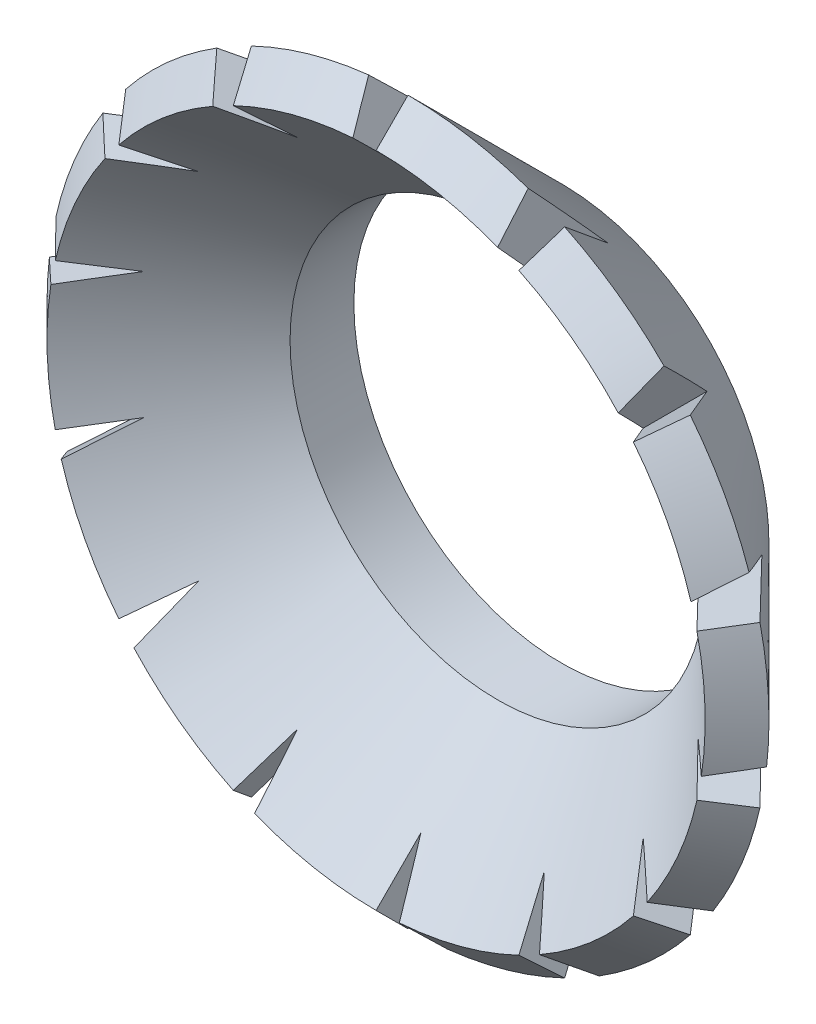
ISO-10303-21;
HEADER;
FILE_DESCRIPTION(('STEP AP214'),'2;1');
FILE_NAME('part.step','',(''),(''),'','','');
FILE_SCHEMA(('AUTOMOTIVE_DESIGN { 1 0 10303 214 1 1 1 1 }'));
ENDSEC;
DATA;
#1=APPLICATION_CONTEXT('core data for automotive mechanical design processes');
#2=APPLICATION_PROTOCOL_DEFINITION('international standard','automotive_design',2000,#1);
#3=PRODUCT_CONTEXT('',#1,'mechanical');
#4=PRODUCT('Part','Part','',(#3));
#5=PRODUCT_RELATED_PRODUCT_CATEGORY('part','',(#4));
#6=PRODUCT_DEFINITION_FORMATION('','',#4);
#7=PRODUCT_DEFINITION_CONTEXT('part definition',#1,'design');
#8=PRODUCT_DEFINITION('design','',#6,#7);
#9=PRODUCT_DEFINITION_SHAPE('','',#8);
#10=(LENGTH_UNIT() NAMED_UNIT(*) SI_UNIT(.MILLI.,.METRE.));
#11=(NAMED_UNIT(*) PLANE_ANGLE_UNIT() SI_UNIT($,.RADIAN.));
#12=(NAMED_UNIT(*) SI_UNIT($,.STERADIAN.) SOLID_ANGLE_UNIT());
#13=UNCERTAINTY_MEASURE_WITH_UNIT(LENGTH_MEASURE(1.E-05),#10,'distance_accuracy_value','');
#14=(GEOMETRIC_REPRESENTATION_CONTEXT(3) GLOBAL_UNCERTAINTY_ASSIGNED_CONTEXT((#13)) GLOBAL_UNIT_ASSIGNED_CONTEXT((#10,
#11,#12)) REPRESENTATION_CONTEXT('',''));
#15=CARTESIAN_POINT('',(0.,0.,0.));
#16=DIRECTION('',(0.,0.,1.));
#17=DIRECTION('',(1.,0.,0.));
#18=AXIS2_PLACEMENT_3D('',#15,#16,#17);
#19=CARTESIAN_POINT('',(0.,0.,0.707106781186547));
#20=DIRECTION('',(0.,0.,1.));
#21=DIRECTION('',(1.,0.,0.));
#22=AXIS2_PLACEMENT_3D('',#19,#20,#21);
#23=CONICAL_SURFACE('',#22,2.3,0.785398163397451);
#24=CARTESIAN_POINT('',(0.,0.,0.707106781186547));
#25=DIRECTION('',(0.,0.,-1.));
#26=DIRECTION('',(-1.,0.,0.));
#27=AXIS2_PLACEMENT_3D('',#24,#25,#26);
#28=CIRCLE('',#27,2.3);
#29=CARTESIAN_POINT('',(-2.3,0.,0.707106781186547));
#30=VERTEX_POINT('',#29);
#31=EDGE_CURVE('E680',#30,#30,#28,.T.);
#32=ORIENTED_EDGE('',*,*,#31,.T.);
#33=EDGE_LOOP('',(#32));
#34=FACE_BOUND('',#33,.T.);
#35=DIRECTION('',(-0.306802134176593,-0.637081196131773,-0.707106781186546));
#36=VECTOR('',#35,1.);
#37=CARTESIAN_POINT('',(0.,0.,-1.59289321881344));
#38=LINE('',#37,#36);
#39=CARTESIAN_POINT('',(1.36673377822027,2.83805193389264,1.55710678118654));
#40=VERTEX_POINT('',#39);
#41=CARTESIAN_POINT('',(1.58213388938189,3.28533487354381,2.05355339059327));
#42=VERTEX_POINT('',#41);
#43=EDGE_CURVE('E314',#40,#42,#38,.F.);
#44=ORIENTED_EDGE('',*,*,#43,.F.);
#45=CARTESIAN_POINT('',(1.34634120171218,3.38901119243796,2.05375339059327));
#46=CARTESIAN_POINT('',(1.34802922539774,3.34340477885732,2.01199317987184));
#47=CARTESIAN_POINT('',(1.34971978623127,3.29772981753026,1.97030778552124));
#48=CARTESIAN_POINT('',(1.35310661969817,3.20622557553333,1.88710862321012));
#49=CARTESIAN_POINT('',(1.35480289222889,3.16039629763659,1.84559485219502));
#50=CARTESIAN_POINT('',(1.35820185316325,3.06856440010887,1.76275928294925));
#51=CARTESIAN_POINT('',(1.35990454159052,3.02256177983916,1.72143748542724));
#52=CARTESIAN_POINT('',(1.36331719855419,2.93035984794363,1.6390125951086));
#53=CARTESIAN_POINT('',(1.3650271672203,2.88416053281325,1.59790950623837));
#54=CARTESIAN_POINT('',(1.36674118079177,2.83785193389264,1.5569298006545));
#55=B_SPLINE_CURVE_WITH_KNOTS('',3,(#45,#46,#47,#48,#49,#50,#51,#52,#53,#54),.UNSPECIFIED.,.F.,
.F.,(4,2,2,2,4),(0.,0.18558127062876,0.371159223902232,0.556737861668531,0.742319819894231),.UNSPECIFIED.);
#56=CARTESIAN_POINT('',(1.34634928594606,3.3887927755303,2.05355339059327));
#57=VERTEX_POINT('',#56);
#58=EDGE_CURVE('E302',#57,#40,#55,.T.);
#59=ORIENTED_EDGE('',*,*,#58,.F.);
#60=CARTESIAN_POINT('',(0.,0.,2.05355339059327));
#61=DIRECTION('',(0.,0.,-1.));
#62=DIRECTION('',(-1.,0.,0.));
#63=AXIS2_PLACEMENT_3D('',#60,#61,#62);
#64=CIRCLE('',#63,3.64644660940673);
#65=CARTESIAN_POINT('',(0.,3.64644660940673,2.05355339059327));
#66=VERTEX_POINT('',#65);
#67=EDGE_CURVE('E679',#66,#57,#64,.T.);
#68=ORIENTED_EDGE('',*,*,#67,.F.);
#69=DIRECTION('',(0.,-0.707106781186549,-0.707106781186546));
#70=VECTOR('',#69,1.);
#71=CARTESIAN_POINT('',(0.,0.,-1.59289321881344));
#72=LINE('',#71,#70);
#73=CARTESIAN_POINT('',(0.,3.15,1.55710678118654));
#74=VERTEX_POINT('',#73);
#75=EDGE_CURVE('E849',#74,#66,#72,.F.);
#76=ORIENTED_EDGE('',*,*,#75,.F.);
#77=CARTESIAN_POINT('',(-0.25742533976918,3.63754913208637,2.05375339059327));
#78=CARTESIAN_POINT('',(-0.236115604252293,3.5971896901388,2.01199122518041));
#79=CARTESIAN_POINT('',(-0.214773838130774,3.55676958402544,1.97030388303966));
#80=CARTESIAN_POINT('',(-0.172018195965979,3.47579279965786,1.88710084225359));
#81=CARTESIAN_POINT('',(-0.150604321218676,3.43523612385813,1.84558514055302));
#82=CARTESIAN_POINT('',(-0.107695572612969,3.35396936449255,1.76274573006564));
#83=CARTESIAN_POINT('',(-0.086200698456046,3.31325928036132,1.72142202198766));
#84=CARTESIAN_POINT('',(-0.0431190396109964,3.23166503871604,1.63899333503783));
#85=CARTESIAN_POINT('',(-0.0215322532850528,3.19078087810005,1.59788836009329));
#86=CARTESIAN_POINT('',(0.000105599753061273,3.1498,1.5569067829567));
#87=B_SPLINE_CURVE_WITH_KNOTS('',3,(#77,#78,#79,#80,#81,#82,#83,#84,#85,#86),.UNSPECIFIED.,.F.,
.F.,(4,2,2,2,4),(0.,0.185589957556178,0.371176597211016,0.556763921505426,0.74235456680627),.UNSPECIFIED.);
#88=CARTESIAN_POINT('',(-0.257323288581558,3.63735585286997,2.05355339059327));
#89=VERTEX_POINT('',#88);
#90=EDGE_CURVE('E516',#89,#74,#87,.T.);
#91=ORIENTED_EDGE('',*,*,#90,.F.);
#92=CARTESIAN_POINT('',(-1.58213388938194,3.28533487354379,2.05355339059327));
#93=VERTEX_POINT('',#92);
#94=EDGE_CURVE('E674',#93,#89,#64,.T.);
#95=ORIENTED_EDGE('',*,*,#94,.F.);
#96=DIRECTION('',(0.306802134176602,-0.637081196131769,-0.707106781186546));
#97=VECTOR('',#96,1.);
#98=CARTESIAN_POINT('',(0.,0.,-1.59289321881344));
#99=LINE('',#98,#97);
#100=CARTESIAN_POINT('',(-1.36673377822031,2.83805193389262,1.55710678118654));
#101=VERTEX_POINT('',#100);
#102=EDGE_CURVE('E1017',#101,#93,#99,.F.);
#103=ORIENTED_EDGE('',*,*,#102,.F.);
#104=CARTESIAN_POINT('',(-1.81020563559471,3.16562585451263,2.05375339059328));
#105=CARTESIAN_POINT('',(-1.77349343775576,3.13850810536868,2.01198953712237));
#106=CARTESIAN_POINT('',(-1.73672605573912,3.11134959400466,1.97030051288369));
#107=CARTESIAN_POINT('',(-1.66306705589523,3.05694080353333,1.8870941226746));
#108=CARTESIAN_POINT('',(-1.62617544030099,3.02969052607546,1.84557675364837));
#109=CARTESIAN_POINT('',(-1.55225265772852,2.97508689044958,1.76273402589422));
#110=CARTESIAN_POINT('',(-1.5152214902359,2.94773353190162,1.7214086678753));
#111=CARTESIAN_POINT('',(-1.44100080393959,2.89290984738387,1.63897670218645));
#112=CARTESIAN_POINT('',(-1.40381128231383,2.86543951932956,1.5978700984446));
#113=CARTESIAN_POINT('',(-1.36653377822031,2.83790420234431,1.55688690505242));
#114=B_SPLINE_CURVE_WITH_KNOTS('',3,(#104,#105,#106,#107,#108,#109,#110,#111,#112,#113),
.UNSPECIFIED.,.F.,.F.,(4,2,2,2,4),(0.,0.185597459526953,0.371191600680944,0.556786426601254,
0.742384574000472),.UNSPECIFIED.);
#115=CARTESIAN_POINT('',(-1.81002982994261,3.1654959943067,2.05355339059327));
#116=VERTEX_POINT('',#115);
#117=EDGE_CURVE('E526',#116,#101,#114,.T.);
#118=ORIENTED_EDGE('',*,*,#117,.F.);
#119=CARTESIAN_POINT('',(-2.85090675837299,2.27352227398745,2.05355339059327));
#120=VERTEX_POINT('',#119);
#121=EDGE_CURVE('E831',#120,#116,#64,.T.);
#122=ORIENTED_EDGE('',*,*,#121,.F.);
#123=DIRECTION('',(0.552838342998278,-0.440873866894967,-0.707106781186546));
#124=VECTOR('',#123,1.);
#125=CARTESIAN_POINT('',(0.,0.,-1.59289321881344));
#126=LINE('',#125,#124);
#127=CARTESIAN_POINT('',(-2.4627691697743,1.96399287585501,1.55710678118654));
#128=VERTEX_POINT('',#127);
#129=EDGE_CURVE('E989',#128,#120,#126,.F.);
#130=ORIENTED_EDGE('',*,*,#129,.F.);
#131=CARTESIAN_POINT('',(-3.00445250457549,2.06671155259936,2.05375339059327));
#132=CARTESIAN_POINT('',(-2.95961364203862,2.05820881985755,2.01199292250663));
#133=CARTESIAN_POINT('',(-2.91470738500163,2.049693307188,1.97030727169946));
#134=CARTESIAN_POINT('',(-2.82474314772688,2.03263351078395,1.88710759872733));
#135=CARTESIAN_POINT('',(-2.77968517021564,2.02408922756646,1.8455935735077));
#136=CARTESIAN_POINT('',(-2.68939878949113,2.00696834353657,1.76275749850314));
#137=CARTESIAN_POINT('',(-2.64417038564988,1.99839174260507,1.72143544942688));
#138=CARTESIAN_POINT('',(-2.55352019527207,1.98120186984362,1.63901005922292));
#139=CARTESIAN_POINT('',(-2.50809840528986,1.97258859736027,1.59790672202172));
#140=CARTESIAN_POINT('',(-2.4625691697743,1.96395495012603,1.55692677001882));
#141=B_SPLINE_CURVE_WITH_KNOTS('',3,(#131,#132,#133,#134,#135,#136,#137,#138,#139,#140),
.UNSPECIFIED.,.F.,.F.,(4,2,2,2,4),(0.,0.185582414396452,0.371161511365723,0.55674129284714,
0.742324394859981),.UNSPECIFIED.);
#142=CARTESIAN_POINT('',(-3.00423776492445,2.06667083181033,2.05355339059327));
#143=VERTEX_POINT('',#142);
#144=EDGE_CURVE('E535',#143,#128,#141,.T.);
#145=ORIENTED_EDGE('',*,*,#144,.F.);
#146=CARTESIAN_POINT('',(-3.55502257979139,0.81141070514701,2.05355339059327));
#147=VERTEX_POINT('',#146);
#148=EDGE_CURVE('E827',#147,#143,#64,.T.);
#149=ORIENTED_EDGE('',*,*,#148,.F.);
#150=DIRECTION('',(0.689378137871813,-0.157346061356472,-0.707106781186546));
#151=VECTOR('',#150,1.);
#152=CARTESIAN_POINT('',(0.,0.,-1.59289321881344));
#153=LINE('',#152,#151);
#154=CARTESIAN_POINT('',(-3.07102292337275,0.700940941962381,1.55710678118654));
#155=VERTEX_POINT('',#154);
#156=EDGE_CURVE('E983',#155,#147,#153,.F.);
#157=ORIENTED_EDGE('',*,*,#156,.F.);
#158=CARTESIAN_POINT('',(-3.60363070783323,0.558459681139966,2.05375339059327));
#159=CARTESIAN_POINT('',(-3.55954281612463,0.57025391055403,2.01199266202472));
#160=CARTESIAN_POINT('',(-3.51538865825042,0.582065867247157,1.9703067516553));
#161=CARTESIAN_POINT('',(-3.42693115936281,0.605729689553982,1.88710656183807));
#162=CARTESIAN_POINT('',(-3.38262782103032,0.617581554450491,1.8455922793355));
#163=CARTESIAN_POINT('',(-3.29385357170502,0.641330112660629,1.76275569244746));
#164=CARTESIAN_POINT('',(-3.2493826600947,0.65322680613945,1.72143338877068));
#165=CARTESIAN_POINT('',(-3.16025069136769,0.677071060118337,1.6390074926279));
#166=CARTESIAN_POINT('',(-3.11558963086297,0.689018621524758,1.59790390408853));
#167=CARTESIAN_POINT('',(-3.07082292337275,0.700994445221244,1.55692370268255));
#168=B_SPLINE_CURVE_WITH_KNOTS('',3,(#158,#159,#160,#161,#162,#163,#164,#165,#166,#167),
.UNSPECIFIED.,.F.,.F.,(4,2,2,2,4),(0.,0.185583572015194,0.371163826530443,0.556744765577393,
0.742329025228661),.UNSPECIFIED.);
#169=CARTESIAN_POINT('',(-3.60341956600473,0.558516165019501,2.05355339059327));
#170=VERTEX_POINT('',#169);
#171=EDGE_CURVE('E544',#170,#155,#168,.T.);
#172=ORIENTED_EDGE('',*,*,#171,.F.);
#173=CARTESIAN_POINT('',(-3.55502257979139,-0.811410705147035,2.05355339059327));
#174=VERTEX_POINT('',#173);
#175=EDGE_CURVE('E823',#174,#170,#64,.T.);
#176=ORIENTED_EDGE('',*,*,#175,.F.);
#177=DIRECTION('',(0.689378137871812,0.157346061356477,-0.707106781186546));
#178=VECTOR('',#177,1.);
#179=CARTESIAN_POINT('',(0.,0.,-1.59289321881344));
#180=LINE('',#179,#178);
#181=CARTESIAN_POINT('',(-3.07102292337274,-0.700940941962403,1.55710678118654));
#182=VERTEX_POINT('',#181);
#183=EDGE_CURVE('E950',#182,#174,#180,.F.);
#184=ORIENTED_EDGE('',*,*,#183,.F.);
#185=CARTESIAN_POINT('',(-3.48906565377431,-1.06040197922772,2.05375339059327));
#186=CARTESIAN_POINT('',(-3.45445762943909,-1.03064369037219,2.01198840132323));
#187=CARTESIAN_POINT('',(-3.41979758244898,-1.00084066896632,1.97029824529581));
#188=CARTESIAN_POINT('',(-3.35036036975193,-0.941133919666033,1.88708960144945));
#189=CARTESIAN_POINT('',(-3.31558320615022,-0.911230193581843,1.84557111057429));
#190=CARTESIAN_POINT('',(-3.24589732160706,-0.851309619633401,1.76272615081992));
#191=CARTESIAN_POINT('',(-3.21098860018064,-0.821292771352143,1.72139968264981));
#192=CARTESIAN_POINT('',(-3.14102187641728,-0.761130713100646,1.63896551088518));
#193=CARTESIAN_POINT('',(-3.10596387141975,-0.730985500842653,1.59785781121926));
#194=CARTESIAN_POINT('',(-3.07082292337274,-0.700768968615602,1.55687353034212));
#195=B_SPLINE_CURVE_WITH_KNOTS('',3,(#185,#186,#187,#188,#189,#190,#191,#192,#193,#194),
.UNSPECIFIED.,.F.,.F.,(4,2,2,2,4),(0.,0.185602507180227,0.371201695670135,0.556801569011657,
0.742404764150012),.UNSPECIFIED.);
#196=CARTESIAN_POINT('',(-3.48889992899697,-1.06025947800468,2.05355339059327));
#197=VERTEX_POINT('',#196);
#198=EDGE_CURVE('E553',#197,#182,#195,.T.);
#199=ORIENTED_EDGE('',*,*,#198,.F.);
#200=CARTESIAN_POINT('',(-2.85090675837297,-2.27352227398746,2.05355339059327));
#201=VERTEX_POINT('',#200);
#202=EDGE_CURVE('E819',#201,#197,#64,.T.);
#203=ORIENTED_EDGE('',*,*,#202,.F.);
#204=DIRECTION('',(0.552838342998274,0.440873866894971,-0.707106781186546));
#205=VECTOR('',#204,1.);
#206=CARTESIAN_POINT('',(0.,0.,-1.59289321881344));
#207=LINE('',#206,#205);
#208=CARTESIAN_POINT('',(-2.46276916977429,-1.96399287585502,1.55710678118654));
#209=VERTEX_POINT('',#208);
#210=EDGE_CURVE('E944',#209,#201,#207,.F.);
#211=ORIENTED_EDGE('',*,*,#210,.F.);
#212=CARTESIAN_POINT('',(-2.68344835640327,-2.46923802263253,2.05375339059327));
#213=CARTESIAN_POINT('',(-2.66518073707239,-2.4274142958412,2.01199182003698));
#214=CARTESIAN_POINT('',(-2.64688566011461,-2.38552770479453,1.97030507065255));
#215=CARTESIAN_POINT('',(-2.61023369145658,-2.30161299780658,1.88710321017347));
#216=CARTESIAN_POINT('',(-2.59187680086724,-2.25958488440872,1.84558809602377));
#217=CARTESIAN_POINT('',(-2.55509358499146,-2.17536968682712,1.7627498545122));
#218=CARTESIAN_POINT('',(-2.53666725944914,-2.13318260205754,1.72142672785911));
#219=CARTESIAN_POINT('',(-2.49973582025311,-2.04862804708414,1.63899919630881));
#220=CARTESIAN_POINT('',(-2.48123070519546,-2.00626057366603,1.59789479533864));
#221=CARTESIAN_POINT('',(-2.46268181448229,-1.96379287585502,1.55691378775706));
#222=B_SPLINE_CURVE_WITH_KNOTS('',3,(#212,#213,#214,#215,#216,#217,#218,#219,#220,#221),
.UNSPECIFIED.,.F.,.F.,(4,2,2,2,4),(0.,0.185587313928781,0.371171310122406,0.556755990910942,
0.74234399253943),.UNSPECIFIED.);
#223=CARTESIAN_POINT('',(-2.68336087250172,-2.46903772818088,2.05355339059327));
#224=VERTEX_POINT('',#223);
#225=EDGE_CURVE('E562',#224,#209,#222,.T.);
#226=ORIENTED_EDGE('',*,*,#225,.F.);
#227=CARTESIAN_POINT('',(-1.58213388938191,-3.2853348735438,2.05355339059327));
#228=VERTEX_POINT('',#227);
#229=EDGE_CURVE('E815',#228,#224,#64,.T.);
#230=ORIENTED_EDGE('',*,*,#229,.F.);
#231=DIRECTION('',(0.306802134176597,0.637081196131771,-0.707106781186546));
#232=VECTOR('',#231,1.);
#233=CARTESIAN_POINT('',(0.,0.,-1.59289321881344));
#234=LINE('',#233,#232);
#235=CARTESIAN_POINT('',(-1.36673377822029,-2.83805193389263,1.55710678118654));
#236=VERTEX_POINT('',#235);
#237=EDGE_CURVE('E911',#236,#228,#234,.F.);
#238=ORIENTED_EDGE('',*,*,#237,.F.);
#239=CARTESIAN_POINT('',(-1.34634120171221,-3.38901119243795,2.05375339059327));
#240=CARTESIAN_POINT('',(-1.34802922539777,-3.34340477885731,2.01199317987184));
#241=CARTESIAN_POINT('',(-1.34971978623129,-3.29772981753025,1.97030778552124));
#242=CARTESIAN_POINT('',(-1.35310661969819,-3.20622557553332,1.88710862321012));
#243=CARTESIAN_POINT('',(-1.35480289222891,-3.16039629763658,1.84559485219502));
#244=CARTESIAN_POINT('',(-1.35820185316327,-3.06856440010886,1.76275928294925));
#245=CARTESIAN_POINT('',(-1.35990454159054,-3.02256177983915,1.72143748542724));
#246=CARTESIAN_POINT('',(-1.36331719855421,-2.93035984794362,1.6390125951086));
#247=CARTESIAN_POINT('',(-1.36502716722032,-2.88416053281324,1.59790950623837));
#248=CARTESIAN_POINT('',(-1.36674118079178,-2.83785193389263,1.5569298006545));
#249=B_SPLINE_CURVE_WITH_KNOTS('',3,(#239,#240,#241,#242,#243,#244,#245,#246,#247,#248),
.UNSPECIFIED.,.F.,.F.,(4,2,2,2,4),(0.,0.18558127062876,0.371159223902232,0.55673786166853,
0.74231981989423),.UNSPECIFIED.);
#250=CARTESIAN_POINT('',(-1.34634928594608,-3.38879277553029,2.05355339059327));
#251=VERTEX_POINT('',#250);
#252=EDGE_CURVE('E571',#251,#236,#249,.T.);
#253=ORIENTED_EDGE('',*,*,#252,.F.);
#254=CARTESIAN_POINT('',(0.,-3.64644660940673,2.05355339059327));
#255=VERTEX_POINT('',#254);
#256=EDGE_CURVE('E811',#255,#251,#64,.T.);
#257=ORIENTED_EDGE('',*,*,#256,.F.);
#258=DIRECTION('',(0.,0.707106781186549,-0.707106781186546));
#259=VECTOR('',#258,1.);
#260=CARTESIAN_POINT('',(0.,0.,-1.59289321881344));
#261=LINE('',#260,#259);
#262=CARTESIAN_POINT('',(0.,-3.15,1.55710678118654));
#263=VERTEX_POINT('',#262);
#264=EDGE_CURVE('E906',#263,#255,#261,.F.);
#265=ORIENTED_EDGE('',*,*,#264,.F.);
#266=CARTESIAN_POINT('',(0.257425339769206,-3.63754913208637,2.05375339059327));
#267=CARTESIAN_POINT('',(0.236115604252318,-3.5971896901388,2.01199122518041));
#268=CARTESIAN_POINT('',(0.214773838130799,-3.55676958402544,1.97030388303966));
#269=CARTESIAN_POINT('',(0.172018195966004,-3.47579279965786,1.88710084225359));
#270=CARTESIAN_POINT('',(0.1506043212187,-3.43523612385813,1.84558514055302));
#271=CARTESIAN_POINT('',(0.107695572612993,-3.35396936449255,1.76274573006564));
#272=CARTESIAN_POINT('',(0.0862006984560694,-3.31325928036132,1.72142202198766));
#273=CARTESIAN_POINT('',(0.0431190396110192,-3.23166503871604,1.63899333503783));
#274=CARTESIAN_POINT('',(0.0215322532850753,-3.19078087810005,1.59788836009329));
#275=CARTESIAN_POINT('',(-0.000105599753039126,-3.1498,1.5569067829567));
#276=B_SPLINE_CURVE_WITH_KNOTS('',3,(#266,#267,#268,#269,#270,#271,#272,#273,#274,#275),
.UNSPECIFIED.,.F.,.F.,(4,2,2,2,4),(0.,0.185589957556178,0.371176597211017,0.556763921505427,
0.742354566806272),.UNSPECIFIED.);
#277=CARTESIAN_POINT('',(0.257323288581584,-3.63735585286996,2.05355339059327));
#278=VERTEX_POINT('',#277);
#279=EDGE_CURVE('E580',#278,#263,#276,.T.);
#280=ORIENTED_EDGE('',*,*,#279,.F.);
#281=CARTESIAN_POINT('',(1.58213388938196,-3.28533487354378,2.05355339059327));
#282=VERTEX_POINT('',#281);
#283=EDGE_CURVE('E807',#282,#278,#64,.T.);
#284=ORIENTED_EDGE('',*,*,#283,.F.);
#285=DIRECTION('',(-0.306802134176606,0.637081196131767,-0.707106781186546));
#286=VECTOR('',#285,1.);
#287=CARTESIAN_POINT('',(0.,0.,-1.59289321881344));
#288=LINE('',#287,#286);
#289=CARTESIAN_POINT('',(1.36673377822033,-2.83805193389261,1.55710678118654));
#290=VERTEX_POINT('',#289);
#291=EDGE_CURVE('E874',#290,#282,#288,.F.);
#292=ORIENTED_EDGE('',*,*,#291,.F.);
#293=CARTESIAN_POINT('',(1.81020563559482,-3.16562585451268,2.05375339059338));
#294=CARTESIAN_POINT('',(1.77349343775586,-3.13850810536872,2.01198953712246));
#295=CARTESIAN_POINT('',(1.73672605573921,-3.1113495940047,1.97030051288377));
#296=CARTESIAN_POINT('',(1.66306705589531,-3.05694080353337,1.88709412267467));
#297=CARTESIAN_POINT('',(1.62617544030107,-3.02969052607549,1.84557675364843));
#298=CARTESIAN_POINT('',(1.55225265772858,-2.9750868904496,1.76273402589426));
#299=CARTESIAN_POINT('',(1.51522149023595,-2.94773353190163,1.72140866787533));
#300=CARTESIAN_POINT('',(1.44100080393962,-2.89290984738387,1.63897670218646));
#301=CARTESIAN_POINT('',(1.40381128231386,-2.86543951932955,1.59787009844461));
#302=CARTESIAN_POINT('',(1.36653377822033,-2.8379042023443,1.55688690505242));
#303=B_SPLINE_CURVE_WITH_KNOTS('',3,(#293,#294,#295,#296,#297,#298,#299,#300,#301,#302),
.UNSPECIFIED.,.F.,.F.,(4,2,2,2,4),(0.,0.18559745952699,0.371191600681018,0.556786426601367,
0.74238457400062),.UNSPECIFIED.);
#304=CARTESIAN_POINT('',(1.81002982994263,-3.16549599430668,2.05355339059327));
#305=VERTEX_POINT('',#304);
#306=EDGE_CURVE('E589',#305,#290,#303,.T.);
#307=ORIENTED_EDGE('',*,*,#306,.F.);
#308=CARTESIAN_POINT('',(2.850906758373,-2.27352227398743,2.05355339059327));
#309=VERTEX_POINT('',#308);
#310=EDGE_CURVE('E806',#309,#305,#64,.T.);
#311=ORIENTED_EDGE('',*,*,#310,.F.);
#312=DIRECTION('',(-0.55283834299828,0.440873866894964,-0.707106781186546));
#313=VECTOR('',#312,1.);
#314=CARTESIAN_POINT('',(0.,0.,-1.59289321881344));
#315=LINE('',#314,#313);
#316=CARTESIAN_POINT('',(2.46276916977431,-1.96399287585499,1.55710678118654));
#317=VERTEX_POINT('',#316);
#318=EDGE_CURVE('E1053',#317,#309,#315,.F.);
#319=ORIENTED_EDGE('',*,*,#318,.F.);
#320=CARTESIAN_POINT('',(3.0044525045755,-2.06671155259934,2.05375339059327));
#321=CARTESIAN_POINT('',(2.95961364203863,-2.05820881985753,2.01199292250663));
#322=CARTESIAN_POINT('',(2.91470738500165,-2.04969330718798,1.97030727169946));
#323=CARTESIAN_POINT('',(2.8247431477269,-2.03263351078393,1.88710759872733));
#324=CARTESIAN_POINT('',(2.77968517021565,-2.02408922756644,1.8455935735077));
#325=CARTESIAN_POINT('',(2.68939878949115,-2.00696834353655,1.76275749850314));
#326=CARTESIAN_POINT('',(2.64417038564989,-1.99839174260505,1.72143544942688));
#327=CARTESIAN_POINT('',(2.55352019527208,-1.9812018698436,1.63901005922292));
#328=CARTESIAN_POINT('',(2.50809840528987,-1.97258859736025,1.59790672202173));
#329=CARTESIAN_POINT('',(2.46256916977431,-1.96395495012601,1.55692677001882));
#330=B_SPLINE_CURVE_WITH_KNOTS('',3,(#320,#321,#322,#323,#324,#325,#326,#327,#328,#329),
.UNSPECIFIED.,.F.,.F.,(4,2,2,2,4),(0.,0.185582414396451,0.371161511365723,0.55674129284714,
0.74232439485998),.UNSPECIFIED.);
#331=CARTESIAN_POINT('',(3.00423776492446,-2.06667083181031,2.05355339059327));
#332=VERTEX_POINT('',#331);
#333=EDGE_CURVE('E598',#332,#317,#330,.T.);
#334=ORIENTED_EDGE('',*,*,#333,.F.);
#335=CARTESIAN_POINT('',(3.5550225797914,-0.811410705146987,2.05355339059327));
#336=VERTEX_POINT('',#335);
#337=EDGE_CURVE('E805',#336,#332,#64,.T.);
#338=ORIENTED_EDGE('',*,*,#337,.F.);
#339=DIRECTION('',(-0.689378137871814,0.157346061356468,-0.707106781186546));
#340=VECTOR('',#339,1.);
#341=CARTESIAN_POINT('',(0.,0.,-1.59289321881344));
#342=LINE('',#341,#340);
#343=CARTESIAN_POINT('',(3.07102292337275,-0.700940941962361,1.55710678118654));
#344=VERTEX_POINT('',#343);
#345=EDGE_CURVE('E648',#344,#336,#342,.F.);
#346=ORIENTED_EDGE('',*,*,#345,.F.);
#347=CARTESIAN_POINT('',(3.60363070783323,-0.558459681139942,2.05375339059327));
#348=CARTESIAN_POINT('',(3.55954281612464,-0.570253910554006,2.01199266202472));
#349=CARTESIAN_POINT('',(3.51538865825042,-0.582065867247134,1.9703067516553));
#350=CARTESIAN_POINT('',(3.42693115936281,-0.605729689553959,1.88710656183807));
#351=CARTESIAN_POINT('',(3.38262782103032,-0.617581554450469,1.8455922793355));
#352=CARTESIAN_POINT('',(3.29385357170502,-0.641330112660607,1.76275569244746));
#353=CARTESIAN_POINT('',(3.2493826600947,-0.653226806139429,1.72143338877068));
#354=CARTESIAN_POINT('',(3.1602506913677,-0.677071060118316,1.6390074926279));
#355=CARTESIAN_POINT('',(3.11558963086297,-0.689018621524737,1.59790390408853));
#356=CARTESIAN_POINT('',(3.07082292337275,-0.700994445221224,1.55692370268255));
#357=B_SPLINE_CURVE_WITH_KNOTS('',3,(#347,#348,#349,#350,#351,#352,#353,#354,#355,#356),
.UNSPECIFIED.,.F.,.F.,(4,2,2,2,4),(0.,0.185583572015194,0.371163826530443,0.556744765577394,
0.742329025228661),.UNSPECIFIED.);
#358=CARTESIAN_POINT('',(3.60341956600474,-0.558516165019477,2.05355339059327));
#359=VERTEX_POINT('',#358);
#360=EDGE_CURVE('E607',#359,#344,#357,.T.);
#361=ORIENTED_EDGE('',*,*,#360,.F.);
#362=CARTESIAN_POINT('',(3.55502257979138,0.811410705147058,2.05355339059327));
#363=VERTEX_POINT('',#362);
#364=EDGE_CURVE('E787',#363,#359,#64,.T.);
#365=ORIENTED_EDGE('',*,*,#364,.F.);
#366=DIRECTION('',(-0.68937813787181,-0.157346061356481,-0.707106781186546));
#367=VECTOR('',#366,1.);
#368=CARTESIAN_POINT('',(0.,0.,-1.59289321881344));
#369=LINE('',#368,#367);
#370=CARTESIAN_POINT('',(3.07102292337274,0.700940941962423,1.55710678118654));
#371=VERTEX_POINT('',#370);
#372=EDGE_CURVE('E788',#371,#363,#369,.F.);
#373=ORIENTED_EDGE('',*,*,#372,.F.);
#374=CARTESIAN_POINT('',(3.48906565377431,1.06040197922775,2.05375339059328));
#375=CARTESIAN_POINT('',(3.45445762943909,1.03064369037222,2.01198840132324));
#376=CARTESIAN_POINT('',(3.41979758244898,1.00084066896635,1.97029824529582));
#377=CARTESIAN_POINT('',(3.35036036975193,0.94113391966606,1.88708960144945));
#378=CARTESIAN_POINT('',(3.31558320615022,0.911230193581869,1.8455711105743));
#379=CARTESIAN_POINT('',(3.24589732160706,0.851309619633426,1.76272615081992));
#380=CARTESIAN_POINT('',(3.21098860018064,0.821292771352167,1.72139968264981));
#381=CARTESIAN_POINT('',(3.14102187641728,0.761130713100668,1.63896551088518));
#382=CARTESIAN_POINT('',(3.10596387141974,0.730985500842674,1.59785781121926));
#383=CARTESIAN_POINT('',(3.07082292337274,0.700768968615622,1.55687353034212));
#384=B_SPLINE_CURVE_WITH_KNOTS('',3,(#374,#375,#376,#377,#378,#379,#380,#381,#382,#383),
.UNSPECIFIED.,.F.,.F.,(4,2,2,2,4),(0.,0.185602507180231,0.371201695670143,0.556801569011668,
0.742404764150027),.UNSPECIFIED.);
#385=CARTESIAN_POINT('',(3.48889992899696,1.06025947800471,2.05355339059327));
#386=VERTEX_POINT('',#385);
#387=EDGE_CURVE('E499',#386,#371,#384,.T.);
#388=ORIENTED_EDGE('',*,*,#387,.F.);
#389=CARTESIAN_POINT('',(2.85090675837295,2.27352227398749,2.05355339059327));
#390=VERTEX_POINT('',#389);
#391=EDGE_CURVE('E802',#390,#386,#64,.T.);
#392=ORIENTED_EDGE('',*,*,#391,.F.);
#393=DIRECTION('',(-0.552838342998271,-0.440873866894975,-0.707106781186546));
#394=VECTOR('',#393,1.);
#395=CARTESIAN_POINT('',(0.,0.,-1.59289321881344));
#396=LINE('',#395,#394);
#397=CARTESIAN_POINT('',(2.46276916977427,1.96399287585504,1.55710678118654));
#398=VERTEX_POINT('',#397);
#399=EDGE_CURVE('E1410',#398,#390,#396,.F.);
#400=ORIENTED_EDGE('',*,*,#399,.F.);
#401=CARTESIAN_POINT('',(2.68344835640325,2.46923802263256,2.05375339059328));
#402=CARTESIAN_POINT('',(2.66518073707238,2.42741429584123,2.01199182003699));
#403=CARTESIAN_POINT('',(2.6468856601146,2.38552770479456,1.97030507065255));
#404=CARTESIAN_POINT('',(2.61023369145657,2.30161299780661,1.88710321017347));
#405=CARTESIAN_POINT('',(2.59187680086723,2.25958488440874,1.84558809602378));
#406=CARTESIAN_POINT('',(2.55509358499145,2.17536968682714,1.76274985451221));
#407=CARTESIAN_POINT('',(2.53666725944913,2.13318260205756,1.72142672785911));
#408=CARTESIAN_POINT('',(2.49973582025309,2.04862804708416,1.63899919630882));
#409=CARTESIAN_POINT('',(2.48123070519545,2.00626057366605,1.59789479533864));
#410=CARTESIAN_POINT('',(2.46268181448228,1.96379287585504,1.55691378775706));
#411=B_SPLINE_CURVE_WITH_KNOTS('',3,(#401,#402,#403,#404,#405,#406,#407,#408,#409,#410),
.UNSPECIFIED.,.F.,.F.,(4,2,2,2,4),(0.,0.185587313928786,0.371171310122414,0.556755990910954,
0.742343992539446),.UNSPECIFIED.);
#412=CARTESIAN_POINT('',(2.68336087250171,2.4690377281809,2.05355339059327));
#413=VERTEX_POINT('',#412);
#414=EDGE_CURVE('E335',#413,#398,#411,.T.);
#415=ORIENTED_EDGE('',*,*,#414,.F.);
#416=EDGE_CURVE('E321',#42,#413,#64,.T.);
#417=ORIENTED_EDGE('',*,*,#416,.F.);
#418=EDGE_LOOP('',(#44,#59,#68,#76,#91,#95,#103,#118,#122,#130,#145,#149,#157,#172,#176,#184,
#199,#203,#211,#226,#230,#238,#253,#257,#265,#280,#284,#292,#307,#311,#319,#334,#338,#346,#361,
#365,#373,#388,#392,#400,#415,#417));
#419=FACE_BOUND('',#418,.T.);
#420=ADVANCED_FACE('F35',(#34,#419),#23,.F.);
#421=CARTESIAN_POINT('',(0.,0.,2.05355339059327));
#422=DIRECTION('',(0.,0.,-1.));
#423=DIRECTION('',(-1.,0.,0.));
#424=AXIS2_PLACEMENT_3D('',#421,#422,#423);
#425=CONICAL_SURFACE('',#424,3.64644660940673,0.78539816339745);
#426=DIRECTION('',(0.306802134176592,0.637081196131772,-0.707106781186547));
#427=VECTOR('',#426,1.);
#428=CARTESIAN_POINT('',(0.,0.,5.69999999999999));
#429=LINE('',#428,#427);
#430=CARTESIAN_POINT('',(1.73553495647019,3.6038754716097,1.7));
#431=VERTEX_POINT('',#430);
#432=EDGE_CURVE('E310',#42,#431,#429,.T.);
#433=ORIENTED_EDGE('',*,*,#432,.F.);
#434=ORIENTED_EDGE('',*,*,#416,.T.);
#435=CARTESIAN_POINT('',(2.83679282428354,2.82032028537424,1.6998));
#436=CARTESIAN_POINT('',(2.81130115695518,2.76195709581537,1.75904914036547));
#437=CARTESIAN_POINT('',(2.78576203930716,2.70348526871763,1.81816982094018));
#438=CARTESIAN_POINT('',(2.73458889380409,2.58632431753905,1.93615428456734));
#439=CARTESIAN_POINT('',(2.70895486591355,2.52763519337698,1.99501806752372));
#440=CARTESIAN_POINT('',(2.68327338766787,2.46883743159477,2.05375339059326));
#441=B_SPLINE_CURVE_WITH_KNOTS('',3,(#435,#436,#437,#438,#439,#440),.UNSPECIFIED.,.F.,.F.,(4,2,
4),(0.,0.260956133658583,0.52191236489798),.UNSPECIFIED.);
#442=CARTESIAN_POINT('',(2.83670674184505,2.82012319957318,1.7));
#443=VERTEX_POINT('',#442);
#444=EDGE_CURVE('E323',#443,#413,#441,.T.);
#445=ORIENTED_EDGE('',*,*,#444,.F.);
#446=CARTESIAN_POINT('',(0.,0.,1.69999999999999));
#447=DIRECTION('',(0.,0.,-1.));
#448=DIRECTION('',(-1.,0.,0.));
#449=AXIS2_PLACEMENT_3D('',#446,#447,#448);
#450=CIRCLE('',#449,4.);
#451=EDGE_CURVE('E675',#431,#443,#450,.T.);
#452=ORIENTED_EDGE('',*,*,#451,.F.);
#453=EDGE_LOOP('',(#433,#434,#445,#452));
#454=FACE_BOUND('',#453,.T.);
#455=ADVANCED_FACE('F511',(#454),#425,.T.);
#456=CARTESIAN_POINT('',(1.33217090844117,3.77185905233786,1.69979999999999));
#457=CARTESIAN_POINT('',(1.33452654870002,3.70821521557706,1.75904914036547));
#458=CARTESIAN_POINT('',(1.33688657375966,3.64445291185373,1.81816982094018));
#459=CARTESIAN_POINT('',(1.34161539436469,3.51669134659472,1.93615428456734));
#460=CARTESIAN_POINT('',(1.34398418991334,3.45269208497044,1.99501806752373));
#461=CARTESIAN_POINT('',(1.34635737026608,3.38857435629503,2.05375339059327));
#462=B_SPLINE_CURVE_WITH_KNOTS('',3,(#456,#457,#458,#459,#460,#461),.UNSPECIFIED.,.F.,.F.,(4,2,
4),(0.,0.260956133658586,0.521912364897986),.UNSPECIFIED.);
#463=CARTESIAN_POINT('',(1.3321788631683,3.77164413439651,1.69999999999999));
#464=VERTEX_POINT('',#463);
#465=EDGE_CURVE('E305',#464,#57,#462,.T.);
#466=ORIENTED_EDGE('',*,*,#465,.F.);
#467=CARTESIAN_POINT('',(0.,4.,1.7));
#468=VERTEX_POINT('',#467);
#469=EDGE_CURVE('E670',#468,#464,#450,.T.);
#470=ORIENTED_EDGE('',*,*,#469,.F.);
#471=DIRECTION('',(0.,0.707106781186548,-0.707106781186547));
#472=VECTOR('',#471,1.);
#473=CARTESIAN_POINT('',(0.,0.,5.69999999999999));
#474=LINE('',#473,#472);
#475=EDGE_CURVE('E850',#66,#468,#474,.T.);
#476=ORIENTED_EDGE('',*,*,#475,.F.);
#477=ORIENTED_EDGE('',*,*,#67,.T.);
#478=EDGE_LOOP('',(#466,#470,#476,#477));
#479=FACE_BOUND('',#478,.T.);
#480=ADVANCED_FACE('F370',(#479),#425,.T.);
#481=CARTESIAN_POINT('',(0.,0.,1.69999999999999));
#482=DIRECTION('',(0.,0.,1.));
#483=DIRECTION('',(1.,0.,0.));
#484=AXIS2_PLACEMENT_3D('',#481,#482,#483);
#485=CONICAL_SURFACE('',#484,4.,0.785398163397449);
#486=CARTESIAN_POINT('',(0.,0.,0.));
#487=DIRECTION('',(0.,0.,-1.));
#488=DIRECTION('',(-1.,0.,0.));
#489=AXIS2_PLACEMENT_3D('',#486,#487,#488);
#490=CIRCLE('',#489,2.3);
#491=CARTESIAN_POINT('',(-2.3,0.,0.));
#492=VERTEX_POINT('',#491);
#493=EDGE_CURVE('E677',#492,#492,#490,.T.);
#494=ORIENTED_EDGE('',*,*,#493,.F.);
#495=EDGE_LOOP('',(#494));
#496=FACE_BOUND('',#495,.T.);
#497=DIRECTION('',(-0.306802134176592,-0.637081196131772,-0.707106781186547));
#498=VECTOR('',#497,1.);
#499=CARTESIAN_POINT('',(0.,0.,-2.3));
#500=LINE('',#499,#498);
#501=CARTESIAN_POINT('',(1.36673377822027,2.83805193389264,0.849999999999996));
#502=VERTEX_POINT('',#501);
#503=EDGE_CURVE('E11',#431,#502,#500,.T.);
#504=ORIENTED_EDGE('',*,*,#503,.F.);
#505=ORIENTED_EDGE('',*,*,#451,.T.);
#506=CARTESIAN_POINT('',(2.46268181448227,1.96379287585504,0.849807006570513));
#507=CARTESIAN_POINT('',(2.49425590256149,2.03608177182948,0.919573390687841));
#508=CARTESIAN_POINT('',(2.52570554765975,2.10808575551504,0.989689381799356));
#509=CARTESIAN_POINT('',(2.58839393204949,2.25161085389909,1.13050168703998));
#510=CARTESIAN_POINT('',(2.6196326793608,2.32313198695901,1.20119797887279));
#511=CARTESIAN_POINT('',(2.68193926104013,2.46578294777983,1.34305644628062));
#512=CARTESIAN_POINT('',(2.7130070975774,2.5369127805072,1.4142186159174));
#513=CARTESIAN_POINT('',(2.77500035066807,2.67884637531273,1.55693514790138));
#514=CARTESIAN_POINT('',(2.80592576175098,2.7496501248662,1.62848952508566));
#515=CARTESIAN_POINT('',(2.83679282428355,2.82032028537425,1.70019999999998));
#516=B_SPLINE_CURVE_WITH_KNOTS('',3,(#506,#507,#508,#509,#510,#511,#512,#513,#514,#515),
.UNSPECIFIED.,.F.,.F.,(4,2,2,2,4),(0.,0.31592371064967,0.63183533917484,0.94774294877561,
1.26366259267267),.UNSPECIFIED.);
#517=CARTESIAN_POINT('',(2.46276916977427,1.96399287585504,0.849999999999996));
#518=VERTEX_POINT('',#517);
#519=EDGE_CURVE('E355',#518,#443,#516,.T.);
#520=ORIENTED_EDGE('',*,*,#519,.F.);
#521=DIRECTION('',(-0.55283834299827,-0.440873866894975,-0.707106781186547));
#522=VECTOR('',#521,1.);
#523=CARTESIAN_POINT('',(0.,0.,-2.3));
#524=LINE('',#523,#522);
#525=CARTESIAN_POINT('',(3.12732592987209,2.49395920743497,1.7));
#526=VERTEX_POINT('',#525);
#527=EDGE_CURVE('E362',#526,#518,#524,.T.);
#528=ORIENTED_EDGE('',*,*,#527,.F.);
#529=CARTESIAN_POINT('',(3.77939006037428,1.31004227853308,1.69999999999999));
#530=VERTEX_POINT('',#529);
#531=EDGE_CURVE('E668',#526,#530,#450,.T.);
#532=ORIENTED_EDGE('',*,*,#531,.T.);
#533=CARTESIAN_POINT('',(3.07082292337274,0.700768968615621,0.849766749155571));
#534=CARTESIAN_POINT('',(3.13063813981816,0.75220208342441,0.919536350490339));
#535=CARTESIAN_POINT('',(3.19021758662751,0.803432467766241,0.989655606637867));
#536=CARTESIAN_POINT('',(3.30897690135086,0.905549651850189,1.13047451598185));
#537=CARTESIAN_POINT('',(3.36815678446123,0.956436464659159,1.20117414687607));
#538=CARTESIAN_POINT('',(3.48619274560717,1.05793166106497,1.34303934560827));
#539=CARTESIAN_POINT('',(3.54504882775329,1.10854004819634,1.41420490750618));
#540=CARTESIAN_POINT('',(3.66249117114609,1.20952481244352,1.55692826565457));
#541=CARTESIAN_POINT('',(3.72107742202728,1.25990118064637,1.62848607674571));
#542=CARTESIAN_POINT('',(3.77955313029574,1.31018249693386,1.7002));
#543=B_SPLINE_CURVE_WITH_KNOTS('',3,(#533,#534,#535,#536,#537,#538,#539,#540,#541,#542),
.UNSPECIFIED.,.F.,.F.,(4,2,2,2,4),(0.,0.315938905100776,0.631865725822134,0.947788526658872,
1.26372336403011),.UNSPECIFIED.);
#544=CARTESIAN_POINT('',(3.07102292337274,0.700940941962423,0.849999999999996));
#545=VERTEX_POINT('',#544);
#546=EDGE_CURVE('E475',#545,#530,#543,.T.);
#547=ORIENTED_EDGE('',*,*,#546,.F.);
#548=DIRECTION('',(-0.689378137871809,-0.157346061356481,-0.707106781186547));
#549=VECTOR('',#548,1.);
#550=CARTESIAN_POINT('',(0.,0.,-2.3));
#551=LINE('',#550,#549);
#552=CARTESIAN_POINT('',(3.89971164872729,0.890083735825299,1.7));
#553=VERTEX_POINT('',#552);
#554=EDGE_CURVE('E363',#553,#545,#551,.T.);
#555=ORIENTED_EDGE('',*,*,#554,.F.);
#556=CARTESIAN_POINT('',(3.97351882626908,-0.459508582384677,1.69999999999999));
#557=VERTEX_POINT('',#556);
#558=EDGE_CURVE('E665',#553,#557,#450,.T.);
#559=ORIENTED_EDGE('',*,*,#558,.T.);
#560=CARTESIAN_POINT('',(3.07082292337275,-0.700994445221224,0.849816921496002));
#561=CARTESIAN_POINT('',(3.14702584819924,-0.680608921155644,0.919582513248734));
#562=CARTESIAN_POINT('',(3.22292844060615,-0.660303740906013,0.989697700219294));
#563=CARTESIAN_POINT('',(3.37422462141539,-0.619829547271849,1.13050837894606));
#564=CARTESIAN_POINT('',(3.44961822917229,-0.599660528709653,1.20120384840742));
#565=CARTESIAN_POINT('',(3.59999295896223,-0.559432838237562,1.34306065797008));
#566=CARTESIAN_POINT('',(3.67497408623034,-0.539374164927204,1.41422199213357));
#567=CARTESIAN_POINT('',(3.82459261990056,-0.499348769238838,1.55693684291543));
#568=CARTESIAN_POINT('',(3.89923001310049,-0.47938205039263,1.62849037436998));
#569=CARTESIAN_POINT('',(3.97372658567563,-0.459453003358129,1.70019999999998));
#570=B_SPLINE_CURVE_WITH_KNOTS('',3,(#560,#561,#562,#563,#564,#565,#566,#567,#568,#569),
.UNSPECIFIED.,.F.,.F.,(4,2,2,2,4),(0.,0.315919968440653,0.631827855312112,0.947731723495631,
1.26364762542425),.UNSPECIFIED.);
#571=CARTESIAN_POINT('',(3.07102292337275,-0.700940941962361,0.849999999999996));
#572=VERTEX_POINT('',#571);
#573=EDGE_CURVE('E468',#572,#557,#570,.T.);
#574=ORIENTED_EDGE('',*,*,#573,.F.);
#575=DIRECTION('',(-0.689378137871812,0.157346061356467,-0.707106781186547));
#576=VECTOR('',#575,1.);
#577=CARTESIAN_POINT('',(0.,0.,-2.3));
#578=LINE('',#577,#576);
#579=CARTESIAN_POINT('',(3.89971164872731,-0.890083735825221,1.7));
#580=VERTEX_POINT('',#579);
#581=EDGE_CURVE('E481',#580,#572,#578,.T.);
#582=ORIENTED_EDGE('',*,*,#581,.F.);
#583=CARTESIAN_POINT('',(3.38064345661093,-2.13804813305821,1.69999999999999));
#584=VERTEX_POINT('',#583);
#585=EDGE_CURVE('E660',#580,#584,#450,.T.);
#586=ORIENTED_EDGE('',*,*,#585,.T.);
#587=CARTESIAN_POINT('',(2.46256916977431,-1.96395495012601,0.849819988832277));
#588=CARTESIAN_POINT('',(2.54007028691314,-1.97865138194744,0.919585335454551));
#589=CARTESIAN_POINT('',(2.61726595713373,-1.99328989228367,0.989700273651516));
#590=CARTESIAN_POINT('',(2.77113962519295,-2.02246874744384,1.13051044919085));
#591=CARTESIAN_POINT('',(2.84781764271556,-2.03700909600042,1.20120566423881));
#592=CARTESIAN_POINT('',(3.00075416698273,-2.06601024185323,1.34306196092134));
#593=CARTESIAN_POINT('',(3.07701267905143,-2.08047104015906,1.41422303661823));
#594=CARTESIAN_POINT('',(3.22918012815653,-2.10932634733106,1.55693736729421));
#595=CARTESIAN_POINT('',(3.30508905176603,-2.1237208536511,1.6284906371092));
#596=CARTESIAN_POINT('',(3.3808547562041,-2.13808820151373,1.70019999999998));
#597=B_SPLINE_CURVE_WITH_KNOTS('',3,(#587,#588,#589,#590,#591,#592,#593,#594,#595,#596),
.UNSPECIFIED.,.F.,.F.,(4,2,2,2,4),(0.,0.315918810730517,0.631825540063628,0.947728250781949,
1.26364299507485),.UNSPECIFIED.);
#598=CARTESIAN_POINT('',(2.46276916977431,-1.96399287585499,0.849999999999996));
#599=VERTEX_POINT('',#598);
#600=EDGE_CURVE('E459',#599,#584,#597,.T.);
#601=ORIENTED_EDGE('',*,*,#600,.F.);
#602=DIRECTION('',(-0.552838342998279,0.440873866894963,-0.707106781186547));
#603=VECTOR('',#602,1.);
#604=CARTESIAN_POINT('',(0.,0.,-2.3));
#605=LINE('',#604,#603);
#606=CARTESIAN_POINT('',(3.12732592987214,-2.49395920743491,1.7));
#607=VERTEX_POINT('',#606);
#608=EDGE_CURVE('E773',#607,#599,#605,.T.);
#609=ORIENTED_EDGE('',*,*,#608,.F.);
#610=CARTESIAN_POINT('',(2.11819018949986,-3.39312102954,1.69999999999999));
#611=VERTEX_POINT('',#610);
#612=EDGE_CURVE('E666',#607,#611,#450,.T.);
#613=ORIENTED_EDGE('',*,*,#612,.T.);
#614=CARTESIAN_POINT('',(1.36653377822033,-2.8379042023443,0.849780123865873));
#615=CARTESIAN_POINT('',(1.42998644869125,-2.88477400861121,0.919548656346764));
#616=CARTESIAN_POINT('',(1.49318901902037,-2.93145907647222,0.989666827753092));
#617=CARTESIAN_POINT('',(1.61917029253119,-3.0245161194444,1.13048354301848));
#618=CARTESIAN_POINT('',(1.68194901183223,-3.07088810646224,1.20118206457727));
#619=CARTESIAN_POINT('',(1.80716296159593,-3.16337835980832,1.34304502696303));
#620=CARTESIAN_POINT('',(1.86959819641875,-3.20949662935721,1.41420946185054));
#621=CARTESIAN_POINT('',(1.99418244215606,-3.30152174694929,1.55693055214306));
#622=CARTESIAN_POINT('',(2.0563314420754,-3.34742858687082,1.62848722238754));
#623=CARTESIAN_POINT('',(2.11836317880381,-3.39324880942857,1.7002));
#624=B_SPLINE_CURVE_WITH_KNOTS('',3,(#614,#615,#616,#617,#618,#619,#620,#621,#622,#623),
.UNSPECIFIED.,.F.,.F.,(4,2,2,2,4),(0.,0.315933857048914,0.631855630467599,0.9477733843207,
1.26370317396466),.UNSPECIFIED.);
#625=CARTESIAN_POINT('',(1.36673377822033,-2.83805193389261,0.849999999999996));
#626=VERTEX_POINT('',#625);
#627=EDGE_CURVE('E450',#626,#611,#624,.T.);
#628=ORIENTED_EDGE('',*,*,#627,.F.);
#629=DIRECTION('',(-0.306802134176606,0.637081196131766,-0.707106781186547));
#630=VECTOR('',#629,1.);
#631=CARTESIAN_POINT('',(0.,0.,-2.3));
#632=LINE('',#631,#630);
#633=CARTESIAN_POINT('',(1.73553495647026,-3.60387547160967,1.7));
#634=VERTEX_POINT('',#633);
#635=EDGE_CURVE('E764',#634,#626,#632,.T.);
#636=ORIENTED_EDGE('',*,*,#635,.F.);
#637=CARTESIAN_POINT('',(0.436203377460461,-3.97614469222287,1.7));
#638=VERTEX_POINT('',#637);
#639=EDGE_CURVE('E669',#634,#638,#450,.T.);
#640=ORIENTED_EDGE('',*,*,#639,.T.);
#641=CARTESIAN_POINT('',(-0.000105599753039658,-3.1498,0.849800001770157));
#642=CARTESIAN_POINT('',(0.0367263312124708,-3.21955760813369,0.919566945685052));
#643=CARTESIAN_POINT('',(0.0734130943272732,-3.28904027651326,0.989683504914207));
#644=CARTESIAN_POINT('',(0.14654059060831,-3.42753964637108,1.13049695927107));
#645=CARTESIAN_POINT('',(0.182981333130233,-3.49655636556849,1.20119383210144));
#646=CARTESIAN_POINT('',(0.255663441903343,-3.63421219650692,1.34305347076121));
#647=CARTESIAN_POINT('',(0.291904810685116,-3.70285131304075,1.41421623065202));
#648=CARTESIAN_POINT('',(0.364221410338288,-3.8398148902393,1.55693395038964));
#649=CARTESIAN_POINT('',(0.400296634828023,-3.90813933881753,1.62848892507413));
#650=CARTESIAN_POINT('',(0.436303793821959,-3.97633487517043,1.70019999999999));
#651=B_SPLINE_CURVE_WITH_KNOTS('',3,(#641,#642,#643,#644,#645,#646,#647,#648,#649,#650),
.UNSPECIFIED.,.F.,.F.,(4,2,2,2,4),(0.,0.315926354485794,0.631840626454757,0.947750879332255,
1.26367316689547),.UNSPECIFIED.);
#652=CARTESIAN_POINT('',(0.,-3.15,0.849999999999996));
#653=VERTEX_POINT('',#652);
#654=EDGE_CURVE('E441',#653,#638,#651,.T.);
#655=ORIENTED_EDGE('',*,*,#654,.F.);
#656=DIRECTION('',(0.,0.707106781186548,-0.707106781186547));
#657=VECTOR('',#656,1.);
#658=CARTESIAN_POINT('',(0.,0.,-2.3));
#659=LINE('',#658,#657);
#660=CARTESIAN_POINT('',(0.,-4.,1.7));
#661=VERTEX_POINT('',#660);
#662=EDGE_CURVE('E754',#661,#653,#659,.T.);
#663=ORIENTED_EDGE('',*,*,#662,.F.);
#664=CARTESIAN_POINT('',(-1.33217886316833,-3.7716441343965,1.7));
#665=VERTEX_POINT('',#664);
#666=EDGE_CURVE('E864',#661,#665,#450,.T.);
#667=ORIENTED_EDGE('',*,*,#666,.T.);
#668=CARTESIAN_POINT('',(-1.36674118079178,-2.83785193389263,0.849823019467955));
#669=CARTESIAN_POINT('',(-1.36382353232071,-2.9166799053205,0.919588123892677));
#670=CARTESIAN_POINT('',(-1.36091738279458,-2.99519720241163,0.989702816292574));
#671=CARTESIAN_POINT('',(-1.35512457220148,-3.15170526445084,1.13051249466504));
#672=CARTESIAN_POINT('',(-1.35223791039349,-3.22969604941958,1.20120745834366));
#673=CARTESIAN_POINT('',(-1.34648037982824,-3.38525092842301,1.34306324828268));
#674=CARTESIAN_POINT('',(-1.34360951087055,-3.46281502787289,1.41422406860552));
#675=CARTESIAN_POINT('',(-1.33788093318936,-3.61758766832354,1.55693788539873));
#676=CARTESIAN_POINT('',(-1.33502322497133,-3.69479619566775,1.62849089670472));
#677=CARTESIAN_POINT('',(-1.3321709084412,-3.77185905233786,1.70019999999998));
#678=B_SPLINE_CURVE_WITH_KNOTS('',3,(#668,#669,#670,#671,#672,#673,#674,#675,#676,#677),
.UNSPECIFIED.,.F.,.F.,(4,2,2,2,4),(0.,0.315917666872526,0.631823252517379,0.947724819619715,
1.26363842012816),.UNSPECIFIED.);
#679=CARTESIAN_POINT('',(-1.36673377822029,-2.83805193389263,0.849999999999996));
#680=VERTEX_POINT('',#679);
#681=EDGE_CURVE('E432',#680,#665,#678,.T.);
#682=ORIENTED_EDGE('',*,*,#681,.F.);
#683=DIRECTION('',(0.306802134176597,0.63708119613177,-0.707106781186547));
#684=VECTOR('',#683,1.);
#685=CARTESIAN_POINT('',(0.,0.,-2.3));
#686=LINE('',#685,#684);
#687=CARTESIAN_POINT('',(-1.73553495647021,-3.60387547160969,1.7));
#688=VERTEX_POINT('',#687);
#689=EDGE_CURVE('E744',#688,#680,#686,.T.);
#690=ORIENTED_EDGE('',*,*,#689,.F.);
#691=CARTESIAN_POINT('',(-2.83670674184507,-2.82012319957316,1.69999999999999));
#692=VERTEX_POINT('',#691);
#693=EDGE_CURVE('E862',#688,#692,#450,.T.);
#694=ORIENTED_EDGE('',*,*,#693,.T.);
#695=CARTESIAN_POINT('',(-2.46268181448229,-1.96379287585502,0.849807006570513));
#696=CARTESIAN_POINT('',(-2.4942559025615,-2.03608177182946,0.919573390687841));
#697=CARTESIAN_POINT('',(-2.52570554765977,-2.10808575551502,0.989689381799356));
#698=CARTESIAN_POINT('',(-2.58839393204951,-2.25161085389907,1.13050168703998));
#699=CARTESIAN_POINT('',(-2.61963267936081,-2.32313198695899,1.20119797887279));
#700=CARTESIAN_POINT('',(-2.68193926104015,-2.46578294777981,1.34305644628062));
#701=CARTESIAN_POINT('',(-2.71300709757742,-2.53691278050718,1.4142186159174));
#702=CARTESIAN_POINT('',(-2.77500035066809,-2.6788463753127,1.55693514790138));
#703=CARTESIAN_POINT('',(-2.805925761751,-2.74965012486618,1.62848952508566));
#704=CARTESIAN_POINT('',(-2.83679282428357,-2.82032028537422,1.70019999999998));
#705=B_SPLINE_CURVE_WITH_KNOTS('',3,(#695,#696,#697,#698,#699,#700,#701,#702,#703,#704),
.UNSPECIFIED.,.F.,.F.,(4,2,2,2,4),(0.,0.31592371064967,0.631835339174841,0.94774294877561,
1.26366259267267),.UNSPECIFIED.);
#706=CARTESIAN_POINT('',(-2.46276916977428,-1.96399287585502,0.849999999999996));
#707=VERTEX_POINT('',#706);
#708=EDGE_CURVE('E423',#707,#692,#705,.T.);
#709=ORIENTED_EDGE('',*,*,#708,.F.);
#710=DIRECTION('',(0.552838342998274,0.44087386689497,-0.707106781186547));
#711=VECTOR('',#710,1.);
#712=CARTESIAN_POINT('',(0.,0.,-2.3));
#713=LINE('',#712,#711);
#714=CARTESIAN_POINT('',(-3.12732592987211,-2.49395920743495,1.7));
#715=VERTEX_POINT('',#714);
#716=EDGE_CURVE('E734',#715,#707,#713,.T.);
#717=ORIENTED_EDGE('',*,*,#716,.F.);
#718=CARTESIAN_POINT('',(-3.77939006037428,-1.31004227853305,1.7));
#719=VERTEX_POINT('',#718);
#720=EDGE_CURVE('E860',#715,#719,#450,.T.);
#721=ORIENTED_EDGE('',*,*,#720,.T.);
#722=CARTESIAN_POINT('',(-3.07082292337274,-0.700768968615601,0.849766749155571));
#723=CARTESIAN_POINT('',(-3.13063813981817,-0.752202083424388,0.91953635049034));
#724=CARTESIAN_POINT('',(-3.19021758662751,-0.803432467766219,0.989655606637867));
#725=CARTESIAN_POINT('',(-3.30897690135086,-0.905549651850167,1.13047451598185));
#726=CARTESIAN_POINT('',(-3.36815678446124,-0.956436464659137,1.20117414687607));
#727=CARTESIAN_POINT('',(-3.48619274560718,-1.05793166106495,1.34303934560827));
#728=CARTESIAN_POINT('',(-3.54504882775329,-1.10854004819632,1.41420490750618));
#729=CARTESIAN_POINT('',(-3.6624911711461,-1.20952481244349,1.55692826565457));
#730=CARTESIAN_POINT('',(-3.72107742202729,-1.25990118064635,1.62848607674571));
#731=CARTESIAN_POINT('',(-3.77955313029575,-1.31018249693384,1.7002));
#732=B_SPLINE_CURVE_WITH_KNOTS('',3,(#722,#723,#724,#725,#726,#727,#728,#729,#730,#731),
.UNSPECIFIED.,.F.,.F.,(4,2,2,2,4),(0.,0.315938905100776,0.631865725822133,0.947788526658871,
1.26372336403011),.UNSPECIFIED.);
#733=CARTESIAN_POINT('',(-3.07102292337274,-0.700940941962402,0.849999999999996));
#734=VERTEX_POINT('',#733);
#735=EDGE_CURVE('E414',#734,#719,#732,.T.);
#736=ORIENTED_EDGE('',*,*,#735,.F.);
#737=DIRECTION('',(0.68937813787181,0.157346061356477,-0.707106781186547));
#738=VECTOR('',#737,1.);
#739=CARTESIAN_POINT('',(0.,0.,-2.3));
#740=LINE('',#739,#738);
#741=CARTESIAN_POINT('',(-3.89971164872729,-0.890083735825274,1.7));
#742=VERTEX_POINT('',#741);
#743=EDGE_CURVE('E724',#742,#734,#740,.T.);
#744=ORIENTED_EDGE('',*,*,#743,.F.);
#745=CARTESIAN_POINT('',(-3.97351882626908,0.459508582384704,1.69999999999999));
#746=VERTEX_POINT('',#745);
#747=EDGE_CURVE('E858',#742,#746,#450,.T.);
#748=ORIENTED_EDGE('',*,*,#747,.T.);
#749=CARTESIAN_POINT('',(-3.07082292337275,0.700994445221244,0.849816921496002));
#750=CARTESIAN_POINT('',(-3.14702584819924,0.680608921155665,0.919582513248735));
#751=CARTESIAN_POINT('',(-3.22292844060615,0.660303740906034,0.989697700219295));
#752=CARTESIAN_POINT('',(-3.37422462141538,0.619829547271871,1.13050837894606));
#753=CARTESIAN_POINT('',(-3.44961822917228,0.599660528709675,1.20120384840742));
#754=CARTESIAN_POINT('',(-3.59999295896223,0.559432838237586,1.34306065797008));
#755=CARTESIAN_POINT('',(-3.67497408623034,0.539374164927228,1.41422199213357));
#756=CARTESIAN_POINT('',(-3.82459261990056,0.499348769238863,1.55693684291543));
#757=CARTESIAN_POINT('',(-3.89923001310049,0.479382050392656,1.62849037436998));
#758=CARTESIAN_POINT('',(-3.97372658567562,0.459453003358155,1.70019999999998));
#759=B_SPLINE_CURVE_WITH_KNOTS('',3,(#749,#750,#751,#752,#753,#754,#755,#756,#757,#758),
.UNSPECIFIED.,.F.,.F.,(4,2,2,2,4),(0.,0.315919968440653,0.631827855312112,0.947731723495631,
1.26364762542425),.UNSPECIFIED.);
#760=CARTESIAN_POINT('',(-3.07102292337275,0.700940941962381,0.849999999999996));
#761=VERTEX_POINT('',#760);
#762=EDGE_CURVE('E405',#761,#746,#759,.T.);
#763=ORIENTED_EDGE('',*,*,#762,.F.);
#764=DIRECTION('',(0.689378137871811,-0.157346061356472,-0.707106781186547));
#765=VECTOR('',#764,1.);
#766=CARTESIAN_POINT('',(0.,0.,-2.3));
#767=LINE('',#766,#765);
#768=CARTESIAN_POINT('',(-3.8997116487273,0.890083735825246,1.7));
#769=VERTEX_POINT('',#768);
#770=EDGE_CURVE('E714',#769,#761,#767,.T.);
#771=ORIENTED_EDGE('',*,*,#770,.F.);
#772=CARTESIAN_POINT('',(-3.38064345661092,2.13804813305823,1.69999999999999));
#773=VERTEX_POINT('',#772);
#774=EDGE_CURVE('E856',#769,#773,#450,.T.);
#775=ORIENTED_EDGE('',*,*,#774,.T.);
#776=CARTESIAN_POINT('',(-2.4625691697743,1.96395495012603,0.849819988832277));
#777=CARTESIAN_POINT('',(-2.54007028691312,1.97865138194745,0.919585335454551));
#778=CARTESIAN_POINT('',(-2.61726595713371,1.99328989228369,0.989700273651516));
#779=CARTESIAN_POINT('',(-2.77113962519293,2.02246874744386,1.13051044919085));
#780=CARTESIAN_POINT('',(-2.84781764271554,2.03700909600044,1.20120566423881));
#781=CARTESIAN_POINT('',(-3.00075416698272,2.06601024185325,1.34306196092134));
#782=CARTESIAN_POINT('',(-3.07701267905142,2.08047104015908,1.41422303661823));
#783=CARTESIAN_POINT('',(-3.22918012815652,2.10932634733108,1.55693736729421));
#784=CARTESIAN_POINT('',(-3.30508905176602,2.12372085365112,1.6284906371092));
#785=CARTESIAN_POINT('',(-3.38085475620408,2.13808820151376,1.70019999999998));
#786=B_SPLINE_CURVE_WITH_KNOTS('',3,(#776,#777,#778,#779,#780,#781,#782,#783,#784,#785),
.UNSPECIFIED.,.F.,.F.,(4,2,2,2,4),(0.,0.315918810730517,0.631825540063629,0.94772825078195,
1.26364299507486),.UNSPECIFIED.);
#787=CARTESIAN_POINT('',(-2.4627691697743,1.96399287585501,0.849999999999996));
#788=VERTEX_POINT('',#787);
#789=EDGE_CURVE('E396',#788,#773,#786,.T.);
#790=ORIENTED_EDGE('',*,*,#789,.F.);
#791=DIRECTION('',(0.552838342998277,-0.440873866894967,-0.707106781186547));
#792=VECTOR('',#791,1.);
#793=CARTESIAN_POINT('',(0.,0.,-2.3));
#794=LINE('',#793,#792);
#795=CARTESIAN_POINT('',(-3.12732592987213,2.49395920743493,1.7));
#796=VERTEX_POINT('',#795);
#797=EDGE_CURVE('E704',#796,#788,#794,.T.);
#798=ORIENTED_EDGE('',*,*,#797,.F.);
#799=CARTESIAN_POINT('',(-2.11819018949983,3.39312102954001,1.7));
#800=VERTEX_POINT('',#799);
#801=EDGE_CURVE('E855',#796,#800,#450,.T.);
#802=ORIENTED_EDGE('',*,*,#801,.T.);
#803=CARTESIAN_POINT('',(-1.36653377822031,2.8379042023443,0.849780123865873));
#804=CARTESIAN_POINT('',(-1.42998644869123,2.88477400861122,0.919548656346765));
#805=CARTESIAN_POINT('',(-1.49318901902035,2.93145907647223,0.989666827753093));
#806=CARTESIAN_POINT('',(-1.61917029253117,3.02451611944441,1.13048354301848));
#807=CARTESIAN_POINT('',(-1.68194901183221,3.07088810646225,1.20118206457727));
#808=CARTESIAN_POINT('',(-1.80716296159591,3.16337835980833,1.34304502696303));
#809=CARTESIAN_POINT('',(-1.86959819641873,3.20949662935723,1.41420946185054));
#810=CARTESIAN_POINT('',(-1.99418244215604,3.3015217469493,1.55693055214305));
#811=CARTESIAN_POINT('',(-2.05633144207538,3.34742858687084,1.62848722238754));
#812=CARTESIAN_POINT('',(-2.11836317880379,3.39324880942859,1.7002));
#813=B_SPLINE_CURVE_WITH_KNOTS('',3,(#803,#804,#805,#806,#807,#808,#809,#810,#811,#812),
.UNSPECIFIED.,.F.,.F.,(4,2,2,2,4),(0.,0.315933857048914,0.631855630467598,0.947773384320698,
1.26370317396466),.UNSPECIFIED.);
#814=CARTESIAN_POINT('',(-1.36673377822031,2.83805193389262,0.849999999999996));
#815=VERTEX_POINT('',#814);
#816=EDGE_CURVE('E387',#815,#800,#813,.T.);
#817=ORIENTED_EDGE('',*,*,#816,.F.);
#818=DIRECTION('',(0.306802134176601,-0.637081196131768,-0.707106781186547));
#819=VECTOR('',#818,1.);
#820=CARTESIAN_POINT('',(0.,0.,-2.3));
#821=LINE('',#820,#819);
#822=CARTESIAN_POINT('',(-1.73553495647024,3.60387547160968,1.7));
#823=VERTEX_POINT('',#822);
#824=EDGE_CURVE('E694',#823,#815,#821,.T.);
#825=ORIENTED_EDGE('',*,*,#824,.F.);
#826=CARTESIAN_POINT('',(-0.436203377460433,3.97614469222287,1.69999999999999));
#827=VERTEX_POINT('',#826);
#828=EDGE_CURVE('E676',#823,#827,#450,.T.);
#829=ORIENTED_EDGE('',*,*,#828,.T.);
#830=CARTESIAN_POINT('',(0.000105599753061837,3.1498,0.849800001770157));
#831=CARTESIAN_POINT('',(-0.0367263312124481,3.21955760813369,0.919566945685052));
#832=CARTESIAN_POINT('',(-0.07341309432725,3.28904027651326,0.989683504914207));
#833=CARTESIAN_POINT('',(-0.146540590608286,3.42753964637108,1.13049695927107));
#834=CARTESIAN_POINT('',(-0.182981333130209,3.49655636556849,1.20119383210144));
#835=CARTESIAN_POINT('',(-0.255663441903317,3.63421219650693,1.34305347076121));
#836=CARTESIAN_POINT('',(-0.29190481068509,3.70285131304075,1.41421623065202));
#837=CARTESIAN_POINT('',(-0.364221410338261,3.83981489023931,1.55693395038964));
#838=CARTESIAN_POINT('',(-0.400296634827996,3.90813933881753,1.62848892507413));
#839=CARTESIAN_POINT('',(-0.436303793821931,3.97633487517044,1.70019999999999));
#840=B_SPLINE_CURVE_WITH_KNOTS('',3,(#830,#831,#832,#833,#834,#835,#836,#837,#838,#839),
.UNSPECIFIED.,.F.,.F.,(4,2,2,2,4),(0.,0.315926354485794,0.631840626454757,0.947750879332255,
1.26367316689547),.UNSPECIFIED.);
#841=CARTESIAN_POINT('',(0.,3.15,0.849999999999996));
#842=VERTEX_POINT('',#841);
#843=EDGE_CURVE('E377',#842,#827,#840,.T.);
#844=ORIENTED_EDGE('',*,*,#843,.F.);
#845=DIRECTION('',(0.,-0.707106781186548,-0.707106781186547));
#846=VECTOR('',#845,1.);
#847=CARTESIAN_POINT('',(0.,0.,-2.3));
#848=LINE('',#847,#846);
#849=EDGE_CURVE('E684',#468,#842,#848,.T.);
#850=ORIENTED_EDGE('',*,*,#849,.F.);
#851=ORIENTED_EDGE('',*,*,#469,.T.);
#852=CARTESIAN_POINT('',(1.36674118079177,2.83785193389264,0.849823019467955));
#853=CARTESIAN_POINT('',(1.36382353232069,2.9166799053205,0.919588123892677));
#854=CARTESIAN_POINT('',(1.36091738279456,2.99519720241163,0.989702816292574));
#855=CARTESIAN_POINT('',(1.35512457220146,3.15170526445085,1.13051249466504));
#856=CARTESIAN_POINT('',(1.35223791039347,3.22969604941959,1.20120745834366));
#857=CARTESIAN_POINT('',(1.34648037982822,3.38525092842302,1.34306324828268));
#858=CARTESIAN_POINT('',(1.34360951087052,3.4628150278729,1.41422406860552));
#859=CARTESIAN_POINT('',(1.33788093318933,3.61758766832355,1.55693788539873));
#860=CARTESIAN_POINT('',(1.3350232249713,3.69479619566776,1.62849089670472));
#861=CARTESIAN_POINT('',(1.33217090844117,3.77185905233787,1.70019999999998));
#862=B_SPLINE_CURVE_WITH_KNOTS('',3,(#852,#853,#854,#855,#856,#857,#858,#859,#860,#861),
.UNSPECIFIED.,.F.,.F.,(4,2,2,2,4),(0.,0.315917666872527,0.631823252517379,0.947724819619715,
1.26363842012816),.UNSPECIFIED.);
#863=EDGE_CURVE('E43',#502,#464,#862,.T.);
#864=ORIENTED_EDGE('',*,*,#863,.F.);
#865=EDGE_LOOP('',(#504,#505,#520,#528,#532,#547,#555,#559,#574,#582,#586,#601,#609,#613,#628,
#636,#640,#655,#663,#667,#682,#690,#694,#709,#717,#721,#736,#744,#748,#763,#771,#775,#790,#798,
#802,#817,#825,#829,#844,#850,#851,#864));
#866=FACE_BOUND('',#865,.T.);
#867=ADVANCED_FACE('F365',(#496,#866),#485,.T.);
#868=DIRECTION('',(0.552838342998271,0.440873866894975,-0.707106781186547));
#869=VECTOR('',#868,1.);
#870=CARTESIAN_POINT('',(0.,0.,5.69999999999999));
#871=LINE('',#870,#869);
#872=EDGE_CURVE('E803',#390,#526,#871,.T.);
#873=ORIENTED_EDGE('',*,*,#872,.F.);
#874=ORIENTED_EDGE('',*,*,#391,.T.);
#875=CARTESIAN_POINT('',(3.77955313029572,1.31018249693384,1.6998));
#876=CARTESIAN_POINT('',(3.73126309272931,1.26865950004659,1.75904914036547));
#877=CARTESIAN_POINT('',(3.68288316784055,1.22705921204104,1.81816982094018));
#878=CARTESIAN_POINT('',(3.58594352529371,1.14370403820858,1.93615428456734));
#879=CARTESIAN_POINT('',(3.53738380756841,1.10194915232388,1.99501806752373));
#880=CARTESIAN_POINT('',(3.48873420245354,1.06011697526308,2.05375339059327));
#881=B_SPLINE_CURVE_WITH_KNOTS('',3,(#875,#876,#877,#878,#879,#880),.UNSPECIFIED.,.F.,.F.,(4,2,
4),(0.,0.260956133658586,0.521912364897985),.UNSPECIFIED.);
#882=EDGE_CURVE('E492',#530,#386,#881,.T.);
#883=ORIENTED_EDGE('',*,*,#882,.F.);
#884=ORIENTED_EDGE('',*,*,#531,.F.);
#885=EDGE_LOOP('',(#873,#874,#883,#884));
#886=FACE_BOUND('',#885,.T.);
#887=ADVANCED_FACE('F369',(#886),#425,.T.);
#888=DIRECTION('',(0.68937813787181,0.157346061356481,-0.707106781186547));
#889=VECTOR('',#888,1.);
#890=CARTESIAN_POINT('',(0.,0.,5.69999999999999));
#891=LINE('',#890,#889);
#892=EDGE_CURVE('E507',#363,#553,#891,.T.);
#893=ORIENTED_EDGE('',*,*,#892,.F.);
#894=ORIENTED_EDGE('',*,*,#364,.T.);
#895=CARTESIAN_POINT('',(3.97372658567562,-0.459453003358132,1.6998));
#896=CARTESIAN_POINT('',(3.91220261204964,-0.475911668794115,1.75904914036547));
#897=CARTESIAN_POINT('',(3.85056411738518,-0.492400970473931,1.81816982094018));
#898=CARTESIAN_POINT('',(3.72705806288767,-0.525440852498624,1.93615428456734));
#899=CARTESIAN_POINT('',(3.66519050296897,-0.541991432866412,1.99501806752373));
#900=CARTESIAN_POINT('',(3.60320842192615,-0.558572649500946,2.05375339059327));
#901=B_SPLINE_CURVE_WITH_KNOTS('',3,(#895,#896,#897,#898,#899,#900),.UNSPECIFIED.,.F.,.F.,(4,2,
4),(0.,0.260956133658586,0.521912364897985),.UNSPECIFIED.);
#902=EDGE_CURVE('E615',#557,#359,#901,.T.);
#903=ORIENTED_EDGE('',*,*,#902,.F.);
#904=ORIENTED_EDGE('',*,*,#558,.F.);
#905=EDGE_LOOP('',(#893,#894,#903,#904));
#906=FACE_BOUND('',#905,.T.);
#907=ADVANCED_FACE('F785',(#906),#425,.T.);
#908=DIRECTION('',(0.689378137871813,-0.157346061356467,-0.707106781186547));
#909=VECTOR('',#908,1.);
#910=CARTESIAN_POINT('',(0.,0.,5.69999999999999));
#911=LINE('',#910,#909);
#912=EDGE_CURVE('E614',#336,#580,#911,.T.);
#913=ORIENTED_EDGE('',*,*,#912,.F.);
#914=ORIENTED_EDGE('',*,*,#337,.T.);
#915=CARTESIAN_POINT('',(3.38085475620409,-2.13808820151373,1.69979999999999));
#916=CARTESIAN_POINT('',(3.31828242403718,-2.12622269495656,1.75904914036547));
#917=CARTESIAN_POINT('',(3.25559361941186,-2.11433510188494,1.81816982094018));
#918=CARTESIAN_POINT('',(3.12998304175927,-2.09051573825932,1.93615428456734));
#919=CARTESIAN_POINT('',(3.06706126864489,-2.07858396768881,1.99501806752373));
#920=CARTESIAN_POINT('',(3.00402302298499,-2.06663011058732,2.05375339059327));
#921=B_SPLINE_CURVE_WITH_KNOTS('',3,(#915,#916,#917,#918,#919,#920),.UNSPECIFIED.,.F.,.F.,(4,2,
4),(0.,0.260956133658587,0.521912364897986),.UNSPECIFIED.);
#922=EDGE_CURVE('E640',#584,#332,#921,.T.);
#923=ORIENTED_EDGE('',*,*,#922,.F.);
#924=ORIENTED_EDGE('',*,*,#585,.F.);
#925=EDGE_LOOP('',(#913,#914,#923,#924));
#926=FACE_BOUND('',#925,.T.);
#927=ADVANCED_FACE('F664',(#926),#425,.T.);
#928=DIRECTION('',(0.55283834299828,-0.440873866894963,-0.707106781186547));
#929=VECTOR('',#928,1.);
#930=CARTESIAN_POINT('',(0.,0.,5.69999999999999));
#931=LINE('',#930,#929);
#932=EDGE_CURVE('E1052',#309,#607,#931,.T.);
#933=ORIENTED_EDGE('',*,*,#932,.F.);
#934=ORIENTED_EDGE('',*,*,#310,.T.);
#935=CARTESIAN_POINT('',(2.11836317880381,-3.39324880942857,1.69979999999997));
#936=CARTESIAN_POINT('',(2.06713570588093,-3.35540923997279,1.75904914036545));
#937=CARTESIAN_POINT('',(2.01581287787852,-3.31749923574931,1.81816982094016));
#938=CARTESIAN_POINT('',(1.91297649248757,-3.24153834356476,1.93615428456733));
#939=CARTESIAN_POINT('',(1.86146293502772,-3.203487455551,1.99501806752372));
#940=CARTESIAN_POINT('',(1.80985402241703,-3.16536613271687,2.05375339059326));
#941=B_SPLINE_CURVE_WITH_KNOTS('',3,(#935,#936,#937,#938,#939,#940),.UNSPECIFIED.,.F.,.F.,(4,2,
4),(0.,0.260956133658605,0.521912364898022),.UNSPECIFIED.);
#942=EDGE_CURVE('E1058',#611,#305,#941,.T.);
#943=ORIENTED_EDGE('',*,*,#942,.F.);
#944=ORIENTED_EDGE('',*,*,#612,.F.);
#945=EDGE_LOOP('',(#933,#934,#943,#944));
#946=FACE_BOUND('',#945,.T.);
#947=ADVANCED_FACE('F1044',(#946),#425,.T.);
#948=DIRECTION('',(0.306802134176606,-0.637081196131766,-0.707106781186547));
#949=VECTOR('',#948,1.);
#950=CARTESIAN_POINT('',(0.,0.,5.69999999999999));
#951=LINE('',#950,#949);
#952=EDGE_CURVE('E869',#282,#634,#951,.T.);
#953=ORIENTED_EDGE('',*,*,#952,.F.);
#954=ORIENTED_EDGE('',*,*,#283,.T.);
#955=CARTESIAN_POINT('',(0.436303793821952,-3.97633487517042,1.6998));
#956=CARTESIAN_POINT('',(0.406567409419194,-3.9200158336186,1.75904914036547));
#957=CARTESIAN_POINT('',(0.376775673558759,-3.86359195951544,1.81816982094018));
#958=CARTESIAN_POINT('',(0.317081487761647,-3.75053452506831,1.93615428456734));
#959=CARTESIAN_POINT('',(0.287179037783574,-3.69390096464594,1.99501806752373));
#960=CARTESIAN_POINT('',(0.257221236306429,-3.63716257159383,2.05375339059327));
#961=B_SPLINE_CURVE_WITH_KNOTS('',3,(#955,#956,#957,#958,#959,#960),.UNSPECIFIED.,.F.,.F.,(4,2,
4),(0.,0.260956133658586,0.521912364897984),.UNSPECIFIED.);
#962=EDGE_CURVE('E870',#638,#278,#961,.T.);
#963=ORIENTED_EDGE('',*,*,#962,.F.);
#964=ORIENTED_EDGE('',*,*,#639,.F.);
#965=EDGE_LOOP('',(#953,#954,#963,#964));
#966=FACE_BOUND('',#965,.T.);
#967=ADVANCED_FACE('F868',(#966),#425,.T.);
#968=DIRECTION('',(0.,-0.707106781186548,-0.707106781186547));
#969=VECTOR('',#968,1.);
#970=CARTESIAN_POINT('',(0.,0.,5.69999999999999));
#971=LINE('',#970,#969);
#972=EDGE_CURVE('E873',#255,#661,#971,.T.);
#973=ORIENTED_EDGE('',*,*,#972,.F.);
#974=ORIENTED_EDGE('',*,*,#256,.T.);
#975=CARTESIAN_POINT('',(-1.3321709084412,-3.77185905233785,1.6998));
#976=CARTESIAN_POINT('',(-1.33452654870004,-3.70821521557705,1.75904914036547));
#977=CARTESIAN_POINT('',(-1.33688657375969,-3.64445291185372,1.81816982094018));
#978=CARTESIAN_POINT('',(-1.34161539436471,-3.51669134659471,1.93615428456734));
#979=CARTESIAN_POINT('',(-1.34398418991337,-3.45269208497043,1.99501806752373));
#980=CARTESIAN_POINT('',(-1.3463573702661,-3.38857435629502,2.05375339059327));
#981=B_SPLINE_CURVE_WITH_KNOTS('',3,(#975,#976,#977,#978,#979,#980),.UNSPECIFIED.,.F.,.F.,(4,2,
4),(0.,0.260956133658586,0.521912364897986),.UNSPECIFIED.);
#982=EDGE_CURVE('E898',#665,#251,#981,.T.);
#983=ORIENTED_EDGE('',*,*,#982,.F.);
#984=ORIENTED_EDGE('',*,*,#666,.F.);
#985=EDGE_LOOP('',(#973,#974,#983,#984));
#986=FACE_BOUND('',#985,.T.);
#987=ADVANCED_FACE('F908',(#986),#425,.T.);
#988=DIRECTION('',(-0.306802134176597,-0.63708119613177,-0.707106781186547));
#989=VECTOR('',#988,1.);
#990=CARTESIAN_POINT('',(0.,0.,5.69999999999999));
#991=LINE('',#990,#989);
#992=EDGE_CURVE('E912',#228,#688,#991,.T.);
#993=ORIENTED_EDGE('',*,*,#992,.F.);
#994=ORIENTED_EDGE('',*,*,#229,.T.);
#995=CARTESIAN_POINT('',(-2.83679282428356,-2.82032028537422,1.6998));
#996=CARTESIAN_POINT('',(-2.8113011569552,-2.76195709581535,1.75904914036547));
#997=CARTESIAN_POINT('',(-2.78576203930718,-2.7034852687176,1.81816982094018));
#998=CARTESIAN_POINT('',(-2.73458889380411,-2.58632431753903,1.93615428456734));
#999=CARTESIAN_POINT('',(-2.70895486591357,-2.52763519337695,1.99501806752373));
#1000=CARTESIAN_POINT('',(-2.68327338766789,-2.46883743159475,2.05375339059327));
#1001=B_SPLINE_CURVE_WITH_KNOTS('',3,(#995,#996,#997,#998,#999,#1000),.UNSPECIFIED.,.F.,.F.,(4,
2,4),(0.,0.260956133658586,0.521912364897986),.UNSPECIFIED.);
#1002=EDGE_CURVE('E916',#692,#224,#1001,.T.);
#1003=ORIENTED_EDGE('',*,*,#1002,.F.);
#1004=ORIENTED_EDGE('',*,*,#693,.F.);
#1005=EDGE_LOOP('',(#993,#994,#1003,#1004));
#1006=FACE_BOUND('',#1005,.T.);
#1007=ADVANCED_FACE('F1034',(#1006),#425,.T.);
#1008=DIRECTION('',(-0.552838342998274,-0.440873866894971,-0.707106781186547));
#1009=VECTOR('',#1008,1.);
#1010=CARTESIAN_POINT('',(0.,0.,5.69999999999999));
#1011=LINE('',#1010,#1009);
#1012=EDGE_CURVE('E945',#201,#715,#1011,.T.);
#1013=ORIENTED_EDGE('',*,*,#1012,.F.);
#1014=ORIENTED_EDGE('',*,*,#202,.T.);
#1015=CARTESIAN_POINT('',(-3.77955313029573,-1.31018249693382,1.6998));
#1016=CARTESIAN_POINT('',(-3.73126309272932,-1.26865950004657,1.75904914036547));
#1017=CARTESIAN_POINT('',(-3.68288316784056,-1.22705921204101,1.81816982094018));
#1018=CARTESIAN_POINT('',(-3.58594352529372,-1.14370403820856,1.93615428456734));
#1019=CARTESIAN_POINT('',(-3.53738380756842,-1.10194915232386,1.99501806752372));
#1020=CARTESIAN_POINT('',(-3.48873420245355,-1.06011697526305,2.05375339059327));
#1021=B_SPLINE_CURVE_WITH_KNOTS('',3,(#1015,#1016,#1017,#1018,#1019,#1020),.UNSPECIFIED.,.F.,
.F.,(4,2,4),(0.,0.260956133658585,0.521912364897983),.UNSPECIFIED.);
#1022=EDGE_CURVE('E936',#719,#197,#1021,.T.);
#1023=ORIENTED_EDGE('',*,*,#1022,.F.);
#1024=ORIENTED_EDGE('',*,*,#720,.F.);
#1025=EDGE_LOOP('',(#1013,#1014,#1023,#1024));
#1026=FACE_BOUND('',#1025,.T.);
#1027=ADVANCED_FACE('F1030',(#1026),#425,.T.);
#1028=DIRECTION('',(-0.689378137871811,-0.157346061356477,-0.707106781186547));
#1029=VECTOR('',#1028,1.);
#1030=CARTESIAN_POINT('',(0.,0.,5.69999999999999));
#1031=LINE('',#1030,#1029);
#1032=EDGE_CURVE('E951',#174,#742,#1031,.T.);
#1033=ORIENTED_EDGE('',*,*,#1032,.F.);
#1034=ORIENTED_EDGE('',*,*,#175,.T.);
#1035=CARTESIAN_POINT('',(-3.97372658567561,0.459453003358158,1.6998));
#1036=CARTESIAN_POINT('',(-3.91220261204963,0.475911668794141,1.75904914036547));
#1037=CARTESIAN_POINT('',(-3.85056411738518,0.492400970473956,1.81816982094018));
#1038=CARTESIAN_POINT('',(-3.72705806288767,0.525440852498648,1.93615428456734));
#1039=CARTESIAN_POINT('',(-3.66519050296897,0.541991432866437,1.99501806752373));
#1040=CARTESIAN_POINT('',(-3.60320842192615,0.55857264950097,2.05375339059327));
#1041=B_SPLINE_CURVE_WITH_KNOTS('',3,(#1035,#1036,#1037,#1038,#1039,#1040),.UNSPECIFIED.,.F.,
.F.,(4,2,4),(0.,0.260956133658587,0.521912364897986),.UNSPECIFIED.);
#1042=EDGE_CURVE('E955',#746,#170,#1041,.T.);
#1043=ORIENTED_EDGE('',*,*,#1042,.F.);
#1044=ORIENTED_EDGE('',*,*,#747,.F.);
#1045=EDGE_LOOP('',(#1033,#1034,#1043,#1044));
#1046=FACE_BOUND('',#1045,.T.);
#1047=ADVANCED_FACE('F1026',(#1046),#425,.T.);
#1048=DIRECTION('',(-0.689378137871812,0.157346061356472,-0.707106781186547));
#1049=VECTOR('',#1048,1.);
#1050=CARTESIAN_POINT('',(0.,0.,5.69999999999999));
#1051=LINE('',#1050,#1049);
#1052=EDGE_CURVE('E984',#147,#769,#1051,.T.);
#1053=ORIENTED_EDGE('',*,*,#1052,.F.);
#1054=ORIENTED_EDGE('',*,*,#148,.T.);
#1055=CARTESIAN_POINT('',(-3.38085475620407,2.13808820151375,1.69979999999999));
#1056=CARTESIAN_POINT('',(-3.31828242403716,2.12622269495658,1.75904914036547));
#1057=CARTESIAN_POINT('',(-3.25559361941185,2.11433510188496,1.81816982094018));
#1058=CARTESIAN_POINT('',(-3.12998304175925,2.09051573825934,1.93615428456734));
#1059=CARTESIAN_POINT('',(-3.06706126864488,2.07858396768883,1.99501806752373));
#1060=CARTESIAN_POINT('',(-3.00402302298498,2.06663011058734,2.05375339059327));
#1061=B_SPLINE_CURVE_WITH_KNOTS('',3,(#1055,#1056,#1057,#1058,#1059,#1060),.UNSPECIFIED.,.F.,
.F.,(4,2,4),(0.,0.260956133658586,0.521912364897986),.UNSPECIFIED.);
#1062=EDGE_CURVE('E975',#773,#143,#1061,.T.);
#1063=ORIENTED_EDGE('',*,*,#1062,.F.);
#1064=ORIENTED_EDGE('',*,*,#774,.F.);
#1065=EDGE_LOOP('',(#1053,#1054,#1063,#1064));
#1066=FACE_BOUND('',#1065,.T.);
#1067=ADVANCED_FACE('F1021',(#1066),#425,.T.);
#1068=DIRECTION('',(-0.552838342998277,0.440873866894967,-0.707106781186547));
#1069=VECTOR('',#1068,1.);
#1070=CARTESIAN_POINT('',(0.,0.,5.69999999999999));
#1071=LINE('',#1070,#1069);
#1072=EDGE_CURVE('E990',#120,#796,#1071,.T.);
#1073=ORIENTED_EDGE('',*,*,#1072,.F.);
#1074=ORIENTED_EDGE('',*,*,#121,.T.);
#1075=CARTESIAN_POINT('',(-2.11836317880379,3.39324880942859,1.69979999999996));
#1076=CARTESIAN_POINT('',(-2.0671357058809,3.3554092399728,1.75904914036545));
#1077=CARTESIAN_POINT('',(-2.0158128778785,3.31749923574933,1.81816982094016));
#1078=CARTESIAN_POINT('',(-1.91297649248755,3.24153834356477,1.93615428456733));
#1079=CARTESIAN_POINT('',(-1.86146293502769,3.20348745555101,1.99501806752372));
#1080=CARTESIAN_POINT('',(-1.80985402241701,3.16536613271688,2.05375339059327));
#1081=B_SPLINE_CURVE_WITH_KNOTS('',3,(#1075,#1076,#1077,#1078,#1079,#1080),.UNSPECIFIED.,.F.,
.F.,(4,2,4),(0.,0.260956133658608,0.521912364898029),.UNSPECIFIED.);
#1082=EDGE_CURVE('E994',#800,#116,#1081,.T.);
#1083=ORIENTED_EDGE('',*,*,#1082,.F.);
#1084=ORIENTED_EDGE('',*,*,#801,.F.);
#1085=EDGE_LOOP('',(#1073,#1074,#1083,#1084));
#1086=FACE_BOUND('',#1085,.T.);
#1087=ADVANCED_FACE('F1019',(#1086),#425,.T.);
#1088=DIRECTION('',(-0.306802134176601,0.637081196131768,-0.707106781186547));
#1089=VECTOR('',#1088,1.);
#1090=CARTESIAN_POINT('',(0.,0.,5.69999999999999));
#1091=LINE('',#1090,#1089);
#1092=EDGE_CURVE('E843',#93,#823,#1091,.T.);
#1093=ORIENTED_EDGE('',*,*,#1092,.F.);
#1094=ORIENTED_EDGE('',*,*,#94,.T.);
#1095=CARTESIAN_POINT('',(-0.436303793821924,3.97633487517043,1.69979999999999));
#1096=CARTESIAN_POINT('',(-0.406567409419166,3.92001583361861,1.75904914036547));
#1097=CARTESIAN_POINT('',(-0.376775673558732,3.86359195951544,1.81816982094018));
#1098=CARTESIAN_POINT('',(-0.317081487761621,3.75053452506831,1.93615428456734));
#1099=CARTESIAN_POINT('',(-0.287179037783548,3.69390096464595,1.99501806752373));
#1100=CARTESIAN_POINT('',(-0.257221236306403,3.63716257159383,2.05375339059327));
#1101=B_SPLINE_CURVE_WITH_KNOTS('',3,(#1095,#1096,#1097,#1098,#1099,#1100),.UNSPECIFIED.,.F.,
.F.,(4,2,4),(0.,0.260956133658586,0.521912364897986),.UNSPECIFIED.);
#1102=EDGE_CURVE('E842',#827,#89,#1101,.T.);
#1103=ORIENTED_EDGE('',*,*,#1102,.F.);
#1104=ORIENTED_EDGE('',*,*,#828,.F.);
#1105=EDGE_LOOP('',(#1093,#1094,#1103,#1104));
#1106=FACE_BOUND('',#1105,.T.);
#1107=ADVANCED_FACE('F341',(#1106),#425,.T.);
#1108=CARTESIAN_POINT('',(0.,0.,-3.75797258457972));
#1109=DIRECTION('',(0.,0.,-1.));
#1110=DIRECTION('',(-1.,0.,0.));
#1111=AXIS2_PLACEMENT_3D('',#1108,#1109,#1110);
#1112=CYLINDRICAL_SURFACE('',#1111,2.3);
#1113=ORIENTED_EDGE('',*,*,#31,.F.);
#1114=EDGE_LOOP('',(#1113));
#1115=FACE_BOUND('',#1114,.T.);
#1116=ORIENTED_EDGE('',*,*,#493,.T.);
#1117=EDGE_LOOP('',(#1116));
#1118=FACE_BOUND('',#1117,.T.);
#1119=ADVANCED_FACE('F37',(#1115,#1118),#1112,.F.);
#1120=CARTESIAN_POINT('',(0.,3.15,2.05355339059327));
#1121=DIRECTION('',(-1.,0.,0.));
#1122=DIRECTION('',(0.,0.,1.));
#1123=AXIS2_PLACEMENT_3D('',#1120,#1121,#1122);
#1124=PLANE('',#1123);
#1125=ORIENTED_EDGE('',*,*,#75,.T.);
#1126=ORIENTED_EDGE('',*,*,#475,.T.);
#1127=ORIENTED_EDGE('',*,*,#849,.T.);
#1128=DIRECTION('',(0.,0.,-1.));
#1129=VECTOR('',#1128,1.);
#1130=CARTESIAN_POINT('',(0.,3.15,2.05355339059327));
#1131=LINE('',#1130,#1129);
#1132=EDGE_CURVE('E847',#74,#842,#1131,.T.);
#1133=ORIENTED_EDGE('',*,*,#1132,.F.);
#1134=EDGE_LOOP('',(#1125,#1126,#1127,#1133));
#1135=FACE_BOUND('',#1134,.T.);
#1136=ADVANCED_FACE('F372',(#1135),#1124,.T.);
#1137=CARTESIAN_POINT('',(-0.448798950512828,4.,2.05355339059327));
#1138=DIRECTION('',(0.884304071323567,0.466911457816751,0.));
#1139=DIRECTION('',(-0.466911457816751,0.884304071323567,0.));
#1140=AXIS2_PLACEMENT_3D('',#1137,#1138,#1139);
#1141=PLANE('',#1140);
#1142=ORIENTED_EDGE('',*,*,#90,.T.);
#1143=ORIENTED_EDGE('',*,*,#1132,.T.);
#1144=ORIENTED_EDGE('',*,*,#843,.T.);
#1145=ORIENTED_EDGE('',*,*,#1102,.T.);
#1146=EDGE_LOOP('',(#1142,#1143,#1144,#1145));
#1147=FACE_BOUND('',#1146,.T.);
#1148=ADVANCED_FACE('F846',(#1147),#1141,.T.);
#1149=CARTESIAN_POINT('',(-1.36673377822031,2.83805193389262,2.05355339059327));
#1150=DIRECTION('',(-0.900968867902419,-0.433883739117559,0.));
#1151=DIRECTION('',(0.433883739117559,-0.900968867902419,0.));
#1152=AXIS2_PLACEMENT_3D('',#1149,#1150,#1151);
#1153=PLANE('',#1152);
#1154=ORIENTED_EDGE('',*,*,#102,.T.);
#1155=ORIENTED_EDGE('',*,*,#1092,.T.);
#1156=ORIENTED_EDGE('',*,*,#824,.T.);
#1157=DIRECTION('',(0.,0.,-1.));
#1158=VECTOR('',#1157,1.);
#1159=CARTESIAN_POINT('',(-1.36673377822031,2.83805193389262,2.05355339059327));
#1160=LINE('',#1159,#1158);
#1161=EDGE_CURVE('E991',#101,#815,#1160,.T.);
#1162=ORIENTED_EDGE('',*,*,#1161,.F.);
#1163=EDGE_LOOP('',(#1154,#1155,#1156,#1162));
#1164=FACE_BOUND('',#1163,.T.);
#1165=ADVANCED_FACE('F1003',(#1164),#1153,.T.);
#1166=CARTESIAN_POINT('',(-2.13988883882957,3.40914890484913,2.05355339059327));
#1167=DIRECTION('',(0.594145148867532,0.804357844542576,0.));
#1168=DIRECTION('',(-0.804357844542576,0.594145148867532,0.));
#1169=AXIS2_PLACEMENT_3D('',#1166,#1167,#1168);
#1170=PLANE('',#1169);
#1171=ORIENTED_EDGE('',*,*,#117,.T.);
#1172=ORIENTED_EDGE('',*,*,#1161,.T.);
#1173=ORIENTED_EDGE('',*,*,#816,.T.);
#1174=ORIENTED_EDGE('',*,*,#1082,.T.);
#1175=EDGE_LOOP('',(#1171,#1172,#1173,#1174));
#1176=FACE_BOUND('',#1175,.T.);
#1177=ADVANCED_FACE('F999',(#1176),#1170,.T.);
#1178=CARTESIAN_POINT('',(-2.4627691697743,1.96399287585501,2.05355339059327));
#1179=DIRECTION('',(-0.623489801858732,-0.781831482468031,0.));
#1180=DIRECTION('',(0.781831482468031,-0.623489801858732,0.));
#1181=AXIS2_PLACEMENT_3D('',#1178,#1179,#1180);
#1182=PLANE('',#1181);
#1183=ORIENTED_EDGE('',*,*,#129,.T.);
#1184=ORIENTED_EDGE('',*,*,#1072,.T.);
#1185=ORIENTED_EDGE('',*,*,#797,.T.);
#1186=DIRECTION('',(0.,0.,-1.));
#1187=VECTOR('',#1186,1.);
#1188=CARTESIAN_POINT('',(-2.4627691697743,1.96399287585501,2.05355339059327));
#1189=LINE('',#1188,#1187);
#1190=EDGE_CURVE('E981',#128,#788,#1189,.T.);
#1191=ORIENTED_EDGE('',*,*,#1190,.F.);
#1192=EDGE_LOOP('',(#1183,#1184,#1185,#1191));
#1193=FACE_BOUND('',#1192,.T.);
#1194=ADVANCED_FACE('F972',(#1193),#1182,.T.);
#1195=CARTESIAN_POINT('',(-3.40714749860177,2.14307405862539,2.05355339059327));
#1196=DIRECTION('',(0.186308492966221,0.982491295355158,0.));
#1197=DIRECTION('',(-0.982491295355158,0.186308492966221,0.));
#1198=AXIS2_PLACEMENT_3D('',#1195,#1196,#1197);
#1199=PLANE('',#1198);
#1200=ORIENTED_EDGE('',*,*,#144,.T.);
#1201=ORIENTED_EDGE('',*,*,#1190,.T.);
#1202=ORIENTED_EDGE('',*,*,#789,.T.);
#1203=ORIENTED_EDGE('',*,*,#1062,.T.);
#1204=EDGE_LOOP('',(#1200,#1201,#1202,#1203));
#1205=FACE_BOUND('',#1204,.T.);
#1206=ADVANCED_FACE('F968',(#1205),#1199,.T.);
#1207=CARTESIAN_POINT('',(-3.07102292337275,0.700940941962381,2.05355339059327));
#1208=DIRECTION('',(-0.222520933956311,-0.974927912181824,0.));
#1209=DIRECTION('',(0.974927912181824,-0.222520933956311,0.));
#1210=AXIS2_PLACEMENT_3D('',#1207,#1208,#1209);
#1211=PLANE('',#1210);
#1212=ORIENTED_EDGE('',*,*,#156,.T.);
#1213=ORIENTED_EDGE('',*,*,#1052,.T.);
#1214=ORIENTED_EDGE('',*,*,#770,.T.);
#1215=DIRECTION('',(0.,0.,-1.));
#1216=VECTOR('',#1215,1.);
#1217=CARTESIAN_POINT('',(-3.07102292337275,0.700940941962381,2.05355339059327));
#1218=LINE('',#1217,#1216);
#1219=EDGE_CURVE('E952',#155,#761,#1218,.T.);
#1220=ORIENTED_EDGE('',*,*,#1219,.F.);
#1221=EDGE_LOOP('',(#1212,#1213,#1214,#1220));
#1222=FACE_BOUND('',#1221,.T.);
#1223=ADVANCED_FACE('F964',(#1222),#1211,.T.);
#1224=CARTESIAN_POINT('',(-3.99957881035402,0.45253711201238,2.05355339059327));
#1225=DIRECTION('',(-0.258428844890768,0.966030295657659,0.));
#1226=DIRECTION('',(-0.966030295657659,-0.258428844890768,0.));
#1227=AXIS2_PLACEMENT_3D('',#1224,#1225,#1226);
#1228=PLANE('',#1227);
#1229=ORIENTED_EDGE('',*,*,#171,.T.);
#1230=ORIENTED_EDGE('',*,*,#1219,.T.);
#1231=ORIENTED_EDGE('',*,*,#762,.T.);
#1232=ORIENTED_EDGE('',*,*,#1042,.T.);
#1233=EDGE_LOOP('',(#1229,#1230,#1231,#1232));
#1234=FACE_BOUND('',#1233,.T.);
#1235=ADVANCED_FACE('F960',(#1234),#1228,.T.);
#1236=CARTESIAN_POINT('',(-3.07102292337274,-0.700940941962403,2.05355339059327));
#1237=DIRECTION('',(0.222520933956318,-0.974927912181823,0.));
#1238=DIRECTION('',(0.974927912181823,0.222520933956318,0.));
#1239=AXIS2_PLACEMENT_3D('',#1236,#1237,#1238);
#1240=PLANE('',#1239);
#1241=ORIENTED_EDGE('',*,*,#183,.T.);
#1242=ORIENTED_EDGE('',*,*,#1032,.T.);
#1243=ORIENTED_EDGE('',*,*,#743,.T.);
#1244=DIRECTION('',(0.,0.,-1.));
#1245=VECTOR('',#1244,1.);
#1246=CARTESIAN_POINT('',(-3.07102292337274,-0.700940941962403,2.05355339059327));
#1247=LINE('',#1246,#1245);
#1248=EDGE_CURVE('E942',#182,#734,#1247,.T.);
#1249=ORIENTED_EDGE('',*,*,#1248,.F.);
#1250=EDGE_LOOP('',(#1241,#1242,#1243,#1249));
#1251=FACE_BOUND('',#1250,.T.);
#1252=ADVANCED_FACE('F933',(#1251),#1240,.T.);
#1253=CARTESIAN_POINT('',(-3.79984448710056,-1.32763035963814,2.05355339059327));
#1254=DIRECTION('',(-0.651981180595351,0.758235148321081,0.));
#1255=DIRECTION('',(-0.758235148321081,-0.651981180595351,0.));
#1256=AXIS2_PLACEMENT_3D('',#1253,#1254,#1255);
#1257=PLANE('',#1256);
#1258=ORIENTED_EDGE('',*,*,#198,.T.);
#1259=ORIENTED_EDGE('',*,*,#1248,.T.);
#1260=ORIENTED_EDGE('',*,*,#735,.T.);
#1261=ORIENTED_EDGE('',*,*,#1022,.T.);
#1262=EDGE_LOOP('',(#1258,#1259,#1260,#1261));
#1263=FACE_BOUND('',#1262,.T.);
#1264=ADVANCED_FACE('F929',(#1263),#1257,.T.);
#1265=CARTESIAN_POINT('',(-2.46276916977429,-1.96399287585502,2.05355339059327));
#1266=DIRECTION('',(0.623489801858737,-0.781831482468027,0.));
#1267=DIRECTION('',(0.781831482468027,0.623489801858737,0.));
#1268=AXIS2_PLACEMENT_3D('',#1265,#1266,#1267);
#1269=PLANE('',#1268);
#1270=ORIENTED_EDGE('',*,*,#210,.T.);
#1271=ORIENTED_EDGE('',*,*,#1012,.T.);
#1272=ORIENTED_EDGE('',*,*,#716,.T.);
#1273=DIRECTION('',(0.,0.,-1.));
#1274=VECTOR('',#1273,1.);
#1275=CARTESIAN_POINT('',(-2.46276916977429,-1.96399287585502,2.05355339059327));
#1276=LINE('',#1275,#1274);
#1277=EDGE_CURVE('E913',#209,#707,#1276,.T.);
#1278=ORIENTED_EDGE('',*,*,#1277,.F.);
#1279=EDGE_LOOP('',(#1270,#1271,#1272,#1278));
#1280=FACE_BOUND('',#1279,.T.);
#1281=ADVANCED_FACE('F925',(#1280),#1269,.T.);
#1282=CARTESIAN_POINT('',(-2.84750436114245,-2.84484435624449,2.05355339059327));
#1283=DIRECTION('',(-0.916400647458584,0.400262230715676,0.));
#1284=DIRECTION('',(-0.400262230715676,-0.916400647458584,0.));
#1285=AXIS2_PLACEMENT_3D('',#1282,#1283,#1284);
#1286=PLANE('',#1285);
#1287=ORIENTED_EDGE('',*,*,#225,.T.);
#1288=ORIENTED_EDGE('',*,*,#1277,.T.);
#1289=ORIENTED_EDGE('',*,*,#708,.T.);
#1290=ORIENTED_EDGE('',*,*,#1002,.T.);
#1291=EDGE_LOOP('',(#1287,#1288,#1289,#1290));
#1292=FACE_BOUND('',#1291,.T.);
#1293=ADVANCED_FACE('F921',(#1292),#1286,.T.);
#1294=CARTESIAN_POINT('',(-1.36673377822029,-2.83805193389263,2.05355339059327));
#1295=DIRECTION('',(0.900968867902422,-0.433883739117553,0.));
#1296=DIRECTION('',(0.433883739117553,0.900968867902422,0.));
#1297=AXIS2_PLACEMENT_3D('',#1294,#1295,#1296);
#1298=PLANE('',#1297);
#1299=ORIENTED_EDGE('',*,*,#237,.T.);
#1300=ORIENTED_EDGE('',*,*,#992,.T.);
#1301=ORIENTED_EDGE('',*,*,#689,.T.);
#1302=DIRECTION('',(0.,0.,-1.));
#1303=VECTOR('',#1302,1.);
#1304=CARTESIAN_POINT('',(-1.36673377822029,-2.83805193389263,2.05355339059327));
#1305=LINE('',#1304,#1303);
#1306=EDGE_CURVE('E904',#236,#680,#1305,.T.);
#1307=ORIENTED_EDGE('',*,*,#1306,.F.);
#1308=EDGE_LOOP('',(#1299,#1300,#1301,#1307));
#1309=FACE_BOUND('',#1308,.T.);
#1310=ADVANCED_FACE('F895',(#1309),#1298,.T.);
#1311=CARTESIAN_POINT('',(-1.33118107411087,-3.79860203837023,2.05355339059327));
#1312=DIRECTION('',(-0.999315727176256,-0.0369875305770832,0.));
#1313=DIRECTION('',(0.0369875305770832,-0.999315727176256,0.));
#1314=AXIS2_PLACEMENT_3D('',#1311,#1312,#1313);
#1315=PLANE('',#1314);
#1316=ORIENTED_EDGE('',*,*,#252,.T.);
#1317=ORIENTED_EDGE('',*,*,#1306,.T.);
#1318=ORIENTED_EDGE('',*,*,#681,.T.);
#1319=ORIENTED_EDGE('',*,*,#982,.T.);
#1320=EDGE_LOOP('',(#1316,#1317,#1318,#1319));
#1321=FACE_BOUND('',#1320,.T.);
#1322=ADVANCED_FACE('F891',(#1321),#1315,.T.);
#1323=CARTESIAN_POINT('',(0.,-3.15,2.05355339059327));
#1324=DIRECTION('',(1.,0.,0.));
#1325=DIRECTION('',(0.,1.,0.));
#1326=AXIS2_PLACEMENT_3D('',#1323,#1324,#1325);
#1327=PLANE('',#1326);
#1328=ORIENTED_EDGE('',*,*,#264,.T.);
#1329=ORIENTED_EDGE('',*,*,#972,.T.);
#1330=ORIENTED_EDGE('',*,*,#662,.T.);
#1331=DIRECTION('',(0.,0.,-1.));
#1332=VECTOR('',#1331,1.);
#1333=CARTESIAN_POINT('',(0.,-3.15,2.05355339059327));
#1334=LINE('',#1333,#1332);
#1335=EDGE_CURVE('E872',#263,#653,#1334,.T.);
#1336=ORIENTED_EDGE('',*,*,#1335,.F.);
#1337=EDGE_LOOP('',(#1328,#1329,#1330,#1336));
#1338=FACE_BOUND('',#1337,.T.);
#1339=ADVANCED_FACE('F887',(#1338),#1327,.T.);
#1340=CARTESIAN_POINT('',(0.448798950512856,-4.,2.05355339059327));
#1341=DIRECTION('',(-0.884304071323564,-0.466911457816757,0.));
#1342=DIRECTION('',(0.466911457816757,-0.884304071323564,0.));
#1343=AXIS2_PLACEMENT_3D('',#1340,#1341,#1342);
#1344=PLANE('',#1343);
#1345=ORIENTED_EDGE('',*,*,#279,.T.);
#1346=ORIENTED_EDGE('',*,*,#1335,.T.);
#1347=ORIENTED_EDGE('',*,*,#654,.T.);
#1348=ORIENTED_EDGE('',*,*,#962,.T.);
#1349=EDGE_LOOP('',(#1345,#1346,#1347,#1348));
#1350=FACE_BOUND('',#1349,.T.);
#1351=ADVANCED_FACE('F881',(#1350),#1344,.T.);
#1352=CARTESIAN_POINT('',(1.36673377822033,-2.83805193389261,2.05355339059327));
#1353=DIRECTION('',(0.900968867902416,0.433883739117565,0.));
#1354=DIRECTION('',(-0.433883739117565,0.900968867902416,0.));
#1355=AXIS2_PLACEMENT_3D('',#1352,#1353,#1354);
#1356=PLANE('',#1355);
#1357=ORIENTED_EDGE('',*,*,#291,.T.);
#1358=ORIENTED_EDGE('',*,*,#952,.T.);
#1359=ORIENTED_EDGE('',*,*,#635,.T.);
#1360=DIRECTION('',(0.,0.,-1.));
#1361=VECTOR('',#1360,1.);
#1362=CARTESIAN_POINT('',(1.36673377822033,-2.83805193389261,2.05355339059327));
#1363=LINE('',#1362,#1361);
#1364=EDGE_CURVE('E1059',#290,#626,#1363,.T.);
#1365=ORIENTED_EDGE('',*,*,#1364,.F.);
#1366=EDGE_LOOP('',(#1357,#1358,#1359,#1365));
#1367=FACE_BOUND('',#1366,.T.);
#1368=ADVANCED_FACE('F886',(#1367),#1356,.T.);
#1369=CARTESIAN_POINT('',(2.1398888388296,-3.40914890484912,2.05355339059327));
#1370=DIRECTION('',(-0.594145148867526,-0.80435784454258,0.));
#1371=DIRECTION('',(0.80435784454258,-0.594145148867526,0.));
#1372=AXIS2_PLACEMENT_3D('',#1369,#1370,#1371);
#1373=PLANE('',#1372);
#1374=ORIENTED_EDGE('',*,*,#306,.T.);
#1375=ORIENTED_EDGE('',*,*,#1364,.T.);
#1376=ORIENTED_EDGE('',*,*,#627,.T.);
#1377=ORIENTED_EDGE('',*,*,#942,.T.);
#1378=EDGE_LOOP('',(#1374,#1375,#1376,#1377));
#1379=FACE_BOUND('',#1378,.T.);
#1380=ADVANCED_FACE('F1066',(#1379),#1373,.T.);
#1381=CARTESIAN_POINT('',(2.46276916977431,-1.96399287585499,2.05355339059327));
#1382=DIRECTION('',(0.623489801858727,0.781831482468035,0.));
#1383=DIRECTION('',(-0.781831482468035,0.623489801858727,0.));
#1384=AXIS2_PLACEMENT_3D('',#1381,#1382,#1383);
#1385=PLANE('',#1384);
#1386=ORIENTED_EDGE('',*,*,#318,.T.);
#1387=ORIENTED_EDGE('',*,*,#932,.T.);
#1388=ORIENTED_EDGE('',*,*,#608,.T.);
#1389=DIRECTION('',(0.,0.,-1.));
#1390=VECTOR('',#1389,1.);
#1391=CARTESIAN_POINT('',(2.46276916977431,-1.96399287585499,2.05355339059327));
#1392=LINE('',#1391,#1390);
#1393=EDGE_CURVE('E647',#317,#599,#1392,.T.);
#1394=ORIENTED_EDGE('',*,*,#1393,.F.);
#1395=EDGE_LOOP('',(#1386,#1387,#1388,#1394));
#1396=FACE_BOUND('',#1395,.T.);
#1397=ADVANCED_FACE('F636',(#1396),#1385,.T.);
#1398=CARTESIAN_POINT('',(3.40714749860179,-2.14307405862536,2.05355339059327));
#1399=DIRECTION('',(-0.186308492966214,-0.982491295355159,0.));
#1400=DIRECTION('',(0.982491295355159,-0.186308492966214,0.));
#1401=AXIS2_PLACEMENT_3D('',#1398,#1399,#1400);
#1402=PLANE('',#1401);
#1403=ORIENTED_EDGE('',*,*,#333,.T.);
#1404=ORIENTED_EDGE('',*,*,#1393,.T.);
#1405=ORIENTED_EDGE('',*,*,#600,.T.);
#1406=ORIENTED_EDGE('',*,*,#922,.T.);
#1407=EDGE_LOOP('',(#1403,#1404,#1405,#1406));
#1408=FACE_BOUND('',#1407,.T.);
#1409=ADVANCED_FACE('F631',(#1408),#1402,.T.);
#1410=CARTESIAN_POINT('',(3.07102292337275,-0.700940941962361,2.05355339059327));
#1411=DIRECTION('',(0.222520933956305,0.974927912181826,0.));
#1412=DIRECTION('',(-0.974927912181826,0.222520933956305,0.));
#1413=AXIS2_PLACEMENT_3D('',#1410,#1411,#1412);
#1414=PLANE('',#1413);
#1415=ORIENTED_EDGE('',*,*,#345,.T.);
#1416=ORIENTED_EDGE('',*,*,#912,.T.);
#1417=ORIENTED_EDGE('',*,*,#581,.T.);
#1418=DIRECTION('',(0.,0.,-1.));
#1419=VECTOR('',#1418,1.);
#1420=CARTESIAN_POINT('',(3.07102292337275,-0.700940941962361,2.05355339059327));
#1421=LINE('',#1420,#1419);
#1422=EDGE_CURVE('E781',#344,#572,#1421,.T.);
#1423=ORIENTED_EDGE('',*,*,#1422,.F.);
#1424=EDGE_LOOP('',(#1415,#1416,#1417,#1423));
#1425=FACE_BOUND('',#1424,.T.);
#1426=ADVANCED_FACE('F626',(#1425),#1414,.T.);
#1427=CARTESIAN_POINT('',(3.99957881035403,-0.452537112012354,2.05355339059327));
#1428=DIRECTION('',(0.258428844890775,-0.966030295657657,0.));
#1429=DIRECTION('',(0.966030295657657,0.258428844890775,0.));
#1430=AXIS2_PLACEMENT_3D('',#1427,#1428,#1429);
#1431=PLANE('',#1430);
#1432=ORIENTED_EDGE('',*,*,#360,.T.);
#1433=ORIENTED_EDGE('',*,*,#1422,.T.);
#1434=ORIENTED_EDGE('',*,*,#573,.T.);
#1435=ORIENTED_EDGE('',*,*,#902,.T.);
#1436=EDGE_LOOP('',(#1432,#1433,#1434,#1435));
#1437=FACE_BOUND('',#1436,.T.);
#1438=ADVANCED_FACE('F622',(#1437),#1431,.T.);
#1439=CARTESIAN_POINT('',(3.07102292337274,0.700940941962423,2.05355339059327));
#1440=DIRECTION('',(-0.222520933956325,0.974927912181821,0.));
#1441=DIRECTION('',(-0.974927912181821,-0.222520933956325,0.));
#1442=AXIS2_PLACEMENT_3D('',#1439,#1440,#1441);
#1443=PLANE('',#1442);
#1444=ORIENTED_EDGE('',*,*,#372,.T.);
#1445=ORIENTED_EDGE('',*,*,#892,.T.);
#1446=ORIENTED_EDGE('',*,*,#554,.T.);
#1447=DIRECTION('',(0.,0.,-1.));
#1448=VECTOR('',#1447,1.);
#1449=CARTESIAN_POINT('',(3.07102292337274,0.700940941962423,2.05355339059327));
#1450=LINE('',#1449,#1448);
#1451=EDGE_CURVE('E500',#371,#545,#1450,.T.);
#1452=ORIENTED_EDGE('',*,*,#1451,.F.);
#1453=EDGE_LOOP('',(#1444,#1445,#1446,#1452));
#1454=FACE_BOUND('',#1453,.T.);
#1455=ADVANCED_FACE('F486',(#1454),#1443,.T.);
#1456=CARTESIAN_POINT('',(3.79984448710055,1.32763035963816,2.05355339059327));
#1457=DIRECTION('',(0.651981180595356,-0.758235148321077,0.));
#1458=DIRECTION('',(0.758235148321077,0.651981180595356,0.));
#1459=AXIS2_PLACEMENT_3D('',#1456,#1457,#1458);
#1460=PLANE('',#1459);
#1461=ORIENTED_EDGE('',*,*,#387,.T.);
#1462=ORIENTED_EDGE('',*,*,#1451,.T.);
#1463=ORIENTED_EDGE('',*,*,#546,.T.);
#1464=ORIENTED_EDGE('',*,*,#882,.T.);
#1465=EDGE_LOOP('',(#1461,#1462,#1463,#1464));
#1466=FACE_BOUND('',#1465,.T.);
#1467=ADVANCED_FACE('F482',(#1466),#1460,.T.);
#1468=CARTESIAN_POINT('',(2.46276916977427,1.96399287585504,2.05355339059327));
#1469=DIRECTION('',(-0.623489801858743,0.781831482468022,0.));
#1470=DIRECTION('',(-0.781831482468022,-0.623489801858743,0.));
#1471=AXIS2_PLACEMENT_3D('',#1468,#1469,#1470);
#1472=PLANE('',#1471);
#1473=ORIENTED_EDGE('',*,*,#399,.T.);
#1474=ORIENTED_EDGE('',*,*,#872,.T.);
#1475=ORIENTED_EDGE('',*,*,#527,.T.);
#1476=DIRECTION('',(0.,0.,-1.));
#1477=VECTOR('',#1476,1.);
#1478=CARTESIAN_POINT('',(2.46276916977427,1.96399287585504,2.05355339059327));
#1479=LINE('',#1478,#1477);
#1480=EDGE_CURVE('E57',#398,#518,#1479,.T.);
#1481=ORIENTED_EDGE('',*,*,#1480,.F.);
#1482=EDGE_LOOP('',(#1473,#1474,#1475,#1481));
#1483=FACE_BOUND('',#1482,.T.);
#1484=ADVANCED_FACE('F349',(#1483),#1472,.T.);
#1485=CARTESIAN_POINT('',(2.84750436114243,2.84484435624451,2.05355339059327));
#1486=DIRECTION('',(0.916400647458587,-0.400262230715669,0.));
#1487=DIRECTION('',(0.400262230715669,0.916400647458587,0.));
#1488=AXIS2_PLACEMENT_3D('',#1485,#1486,#1487);
#1489=PLANE('',#1488);
#1490=ORIENTED_EDGE('',*,*,#414,.T.);
#1491=ORIENTED_EDGE('',*,*,#1480,.T.);
#1492=ORIENTED_EDGE('',*,*,#519,.T.);
#1493=ORIENTED_EDGE('',*,*,#444,.T.);
#1494=EDGE_LOOP('',(#1490,#1491,#1492,#1493));
#1495=FACE_BOUND('',#1494,.T.);
#1496=ADVANCED_FACE('F344',(#1495),#1489,.T.);
#1497=CARTESIAN_POINT('',(1.36673377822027,2.83805193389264,2.05355339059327));
#1498=DIRECTION('',(-0.900968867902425,0.433883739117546,0.));
#1499=DIRECTION('',(-0.433883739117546,-0.900968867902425,0.));
#1500=AXIS2_PLACEMENT_3D('',#1497,#1498,#1499);
#1501=PLANE('',#1500);
#1502=ORIENTED_EDGE('',*,*,#43,.T.);
#1503=ORIENTED_EDGE('',*,*,#432,.T.);
#1504=ORIENTED_EDGE('',*,*,#503,.T.);
#1505=DIRECTION('',(0.,0.,-1.));
#1506=VECTOR('',#1505,1.);
#1507=CARTESIAN_POINT('',(1.36673377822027,2.83805193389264,2.05355339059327));
#1508=LINE('',#1507,#1506);
#1509=EDGE_CURVE('E50',#40,#502,#1508,.T.);
#1510=ORIENTED_EDGE('',*,*,#1509,.F.);
#1511=EDGE_LOOP('',(#1502,#1503,#1504,#1510));
#1512=FACE_BOUND('',#1511,.T.);
#1513=ADVANCED_FACE('F313',(#1512),#1501,.T.);
#1514=CARTESIAN_POINT('',(1.33118107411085,3.79860203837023,2.05355339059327));
#1515=DIRECTION('',(0.999315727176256,0.0369875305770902,0.));
#1516=DIRECTION('',(-0.0369875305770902,0.999315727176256,0.));
#1517=AXIS2_PLACEMENT_3D('',#1514,#1515,#1516);
#1518=PLANE('',#1517);
#1519=ORIENTED_EDGE('',*,*,#58,.T.);
#1520=ORIENTED_EDGE('',*,*,#1509,.T.);
#1521=ORIENTED_EDGE('',*,*,#863,.T.);
#1522=ORIENTED_EDGE('',*,*,#465,.T.);
#1523=EDGE_LOOP('',(#1519,#1520,#1521,#1522));
#1524=FACE_BOUND('',#1523,.T.);
#1525=ADVANCED_FACE('F303',(#1524),#1518,.T.);
#1526=CLOSED_SHELL('',(#420,#455,#480,#867,#887,#907,#927,#947,#967,#987,#1007,#1027,#1047,
#1067,#1087,#1107,#1119,#1136,#1148,#1165,#1177,#1194,#1206,#1223,#1235,#1252,#1264,#1281,#1293,
#1310,#1322,#1339,#1351,#1368,#1380,#1397,#1409,#1426,#1438,#1455,#1467,#1484,#1496,#1513,#1525));
#1527=MANIFOLD_SOLID_BREP('B2',#1526);
#1528=ADVANCED_BREP_SHAPE_REPRESENTATION('',(#18,#1527),#14);
#1529=SHAPE_DEFINITION_REPRESENTATION(#9,#1528);
ENDSEC;
END-ISO-10303-21;
